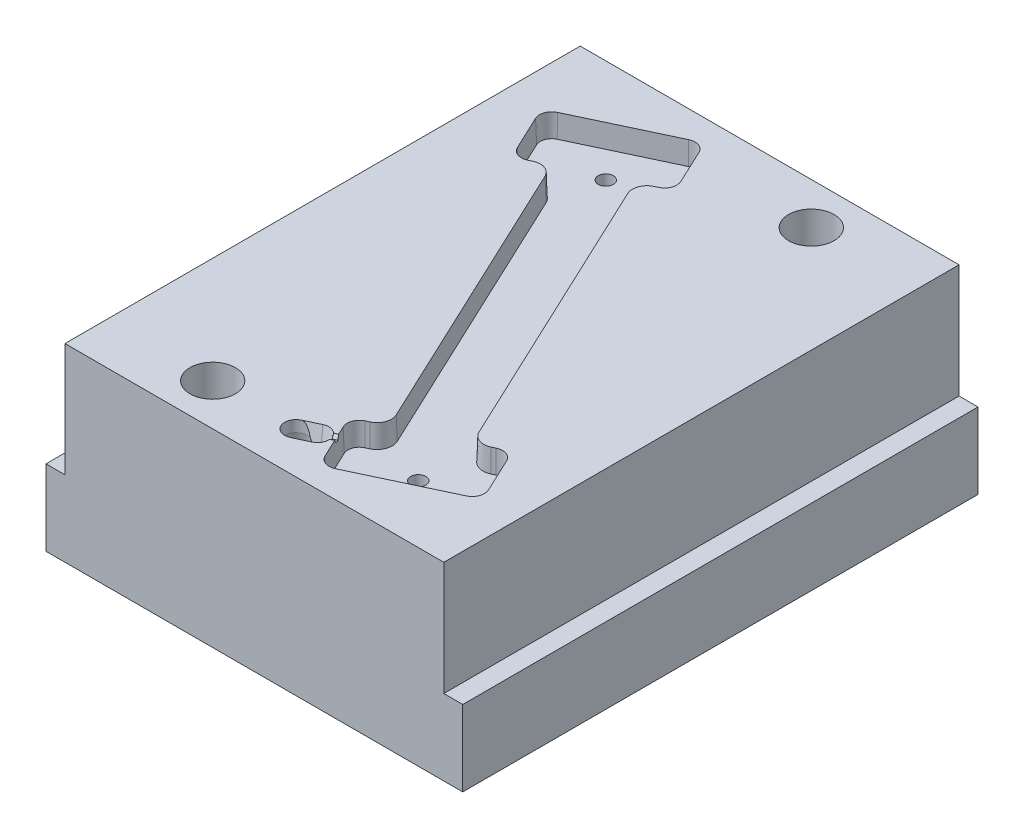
ISO-10303-21;
HEADER;
FILE_DESCRIPTION(('STEP AP214'),'2;1');
FILE_NAME('part.step','',(''),(''),'','','');
FILE_SCHEMA(('AUTOMOTIVE_DESIGN { 1 0 10303 214 1 1 1 1 }'));
ENDSEC;
DATA;
#1=APPLICATION_CONTEXT('core data for automotive mechanical design processes');
#2=APPLICATION_PROTOCOL_DEFINITION('international standard','automotive_design',2000,#1);
#3=PRODUCT_CONTEXT('',#1,'mechanical');
#4=PRODUCT('Part','Part','',(#3));
#5=PRODUCT_RELATED_PRODUCT_CATEGORY('part','',(#4));
#6=PRODUCT_DEFINITION_FORMATION('','',#4);
#7=PRODUCT_DEFINITION_CONTEXT('part definition',#1,'design');
#8=PRODUCT_DEFINITION('design','',#6,#7);
#9=PRODUCT_DEFINITION_SHAPE('','',#8);
#10=(LENGTH_UNIT() NAMED_UNIT(*) SI_UNIT(.MILLI.,.METRE.));
#11=(NAMED_UNIT(*) PLANE_ANGLE_UNIT() SI_UNIT($,.RADIAN.));
#12=(NAMED_UNIT(*) SI_UNIT($,.STERADIAN.) SOLID_ANGLE_UNIT());
#13=UNCERTAINTY_MEASURE_WITH_UNIT(LENGTH_MEASURE(1.E-05),#10,'distance_accuracy_value','');
#14=(GEOMETRIC_REPRESENTATION_CONTEXT(3) GLOBAL_UNCERTAINTY_ASSIGNED_CONTEXT((#13)) GLOBAL_UNIT_ASSIGNED_CONTEXT((#10,
#11,#12)) REPRESENTATION_CONTEXT('',''));
#15=CARTESIAN_POINT('',(0.,0.,0.));
#16=DIRECTION('',(0.,0.,1.));
#17=DIRECTION('',(1.,0.,0.));
#18=AXIS2_PLACEMENT_3D('',#15,#16,#17);
#19=CARTESIAN_POINT('',(25.,25.,68.));
#20=DIRECTION('',(0.,-1.,0.));
#21=DIRECTION('',(0.,0.,-1.));
#22=AXIS2_PLACEMENT_3D('',#19,#20,#21);
#23=PLANE('',#22);
#24=DIRECTION('',(-1.,0.,0.));
#25=VECTOR('',#24,1.);
#26=CARTESIAN_POINT('',(25.,25.,0.));
#27=LINE('',#26,#25);
#28=CARTESIAN_POINT('',(25.,25.,0.));
#29=VERTEX_POINT('',#28);
#30=CARTESIAN_POINT('',(-25.,25.,0.));
#31=VERTEX_POINT('',#30);
#32=EDGE_CURVE('E400',#29,#31,#27,.T.);
#33=ORIENTED_EDGE('',*,*,#32,.T.);
#34=DIRECTION('',(0.,0.,-1.));
#35=VECTOR('',#34,1.);
#36=CARTESIAN_POINT('',(-25.,25.,68.));
#37=LINE('',#36,#35);
#38=CARTESIAN_POINT('',(-25.,25.,68.));
#39=VERTEX_POINT('',#38);
#40=EDGE_CURVE('E478',#39,#31,#37,.T.);
#41=ORIENTED_EDGE('',*,*,#40,.F.);
#42=DIRECTION('',(-1.,0.,0.));
#43=VECTOR('',#42,1.);
#44=CARTESIAN_POINT('',(25.,25.,68.));
#45=LINE('',#44,#43);
#46=CARTESIAN_POINT('',(25.,25.,68.));
#47=VERTEX_POINT('',#46);
#48=EDGE_CURVE('E401',#47,#39,#45,.T.);
#49=ORIENTED_EDGE('',*,*,#48,.F.);
#50=DIRECTION('',(0.,0.,-1.));
#51=VECTOR('',#50,1.);
#52=CARTESIAN_POINT('',(25.,25.,68.));
#53=LINE('',#52,#51);
#54=EDGE_CURVE('E427',#47,#29,#53,.T.);
#55=ORIENTED_EDGE('',*,*,#54,.T.);
#56=EDGE_LOOP('',(#33,#41,#49,#55));
#57=FACE_BOUND('',#56,.T.);
#58=CARTESIAN_POINT('',(11.,25.,5.5));
#59=DIRECTION('',(0.,1.,0.));
#60=DIRECTION('',(0.,0.,1.));
#61=AXIS2_PLACEMENT_3D('',#58,#59,#60);
#62=CIRCLE('',#61,3.);
#63=CARTESIAN_POINT('',(11.,25.,8.5));
#64=VERTEX_POINT('',#63);
#65=EDGE_CURVE('E577',#64,#64,#62,.T.);
#66=ORIENTED_EDGE('',*,*,#65,.F.);
#67=EDGE_LOOP('',(#66));
#68=FACE_BOUND('',#67,.T.);
#69=CARTESIAN_POINT('',(-11.,25.,62.5));
#70=DIRECTION('',(0.,1.,0.));
#71=DIRECTION('',(0.,0.,1.));
#72=AXIS2_PLACEMENT_3D('',#69,#70,#71);
#73=CIRCLE('',#72,3.);
#74=CARTESIAN_POINT('',(-11.,25.,65.5));
#75=VERTEX_POINT('',#74);
#76=EDGE_CURVE('E503',#75,#75,#73,.T.);
#77=ORIENTED_EDGE('',*,*,#76,.F.);
#78=EDGE_LOOP('',(#77));
#79=FACE_BOUND('',#78,.T.);
#80=DIRECTION('',(-0.42579703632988,0.,-0.904818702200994));
#81=VECTOR('',#80,1.);
#82=CARTESIAN_POINT('',(2.88578835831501,25.,59.1666326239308));
#83=LINE('',#82,#81);
#84=CARTESIAN_POINT('',(2.88578835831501,25.,59.1666326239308));
#85=VERTEX_POINT('',#84);
#86=CARTESIAN_POINT('',(3.41746318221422,25.,60.2964416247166));
#87=VERTEX_POINT('',#86);
#88=EDGE_CURVE('E736',#85,#87,#83,.F.);
#89=ORIENTED_EDGE('',*,*,#88,.F.);
#90=CARTESIAN_POINT('',(4.33780730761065,25.,58.4833295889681));
#91=DIRECTION('',(0.,1.,0.));
#92=DIRECTION('',(0.,0.,1.));
#93=AXIS2_PLACEMENT_3D('',#90,#91,#92);
#94=CIRCLE('',#93,1.60476230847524);
#95=CARTESIAN_POINT('',(3.654504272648,25.,57.0313106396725));
#96=VERTEX_POINT('',#95);
#97=EDGE_CURVE('E740',#96,#85,#94,.T.);
#98=ORIENTED_EDGE('',*,*,#97,.F.);
#99=DIRECTION('',(0.904818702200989,0.,-0.425797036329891));
#100=VECTOR('',#99,1.);
#101=CARTESIAN_POINT('',(4.10691362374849,25.,56.8184121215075));
#102=LINE('',#101,#100);
#103=CARTESIAN_POINT('',(4.10691362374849,25.,56.8184121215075));
#104=VERTEX_POINT('',#103);
#105=EDGE_CURVE('E743',#104,#96,#102,.F.);
#106=ORIENTED_EDGE('',*,*,#105,.F.);
#107=CARTESIAN_POINT('',(3.29992703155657,25.,55.1035656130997));
#108=DIRECTION('',(0.,1.,0.));
#109=DIRECTION('',(0.,0.,1.));
#110=AXIS2_PLACEMENT_3D('',#107,#108,#109);
#111=CIRCLE('',#110,1.89523769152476);
#112=CARTESIAN_POINT('',(5.01477353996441,25.,54.2965790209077));
#113=VERTEX_POINT('',#112);
#114=EDGE_CURVE('E746',#113,#104,#111,.F.);
#115=ORIENTED_EDGE('',*,*,#114,.F.);
#116=DIRECTION('',(-0.42579703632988,0.,-0.904818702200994));
#117=VECTOR('',#116,1.);
#118=CARTESIAN_POINT('',(-12.4429049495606,25.,17.199012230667));
#119=LINE('',#118,#117);
#120=CARTESIAN_POINT('',(-12.4429049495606,25.,17.199012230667));
#121=VERTEX_POINT('',#120);
#122=EDGE_CURVE('E749',#121,#113,#119,.F.);
#123=ORIENTED_EDGE('',*,*,#122,.F.);
#124=CARTESIAN_POINT('',(-14.1577514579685,25.,18.0059988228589));
#125=DIRECTION('',(0.,1.,0.));
#126=DIRECTION('',(0.,0.,1.));
#127=AXIS2_PLACEMENT_3D('',#124,#125,#126);
#128=CIRCLE('',#127,1.89523769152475);
#129=CARTESIAN_POINT('',(-14.9647380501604,25.,16.2911523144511));
#130=VERTEX_POINT('',#129);
#131=EDGE_CURVE('E752',#130,#121,#128,.F.);
#132=ORIENTED_EDGE('',*,*,#131,.F.);
#133=DIRECTION('',(-0.904818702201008,0.,0.425797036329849));
#134=VECTOR('',#133,1.);
#135=CARTESIAN_POINT('',(-15.4171474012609,25.,16.504050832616));
#136=LINE('',#135,#134);
#137=CARTESIAN_POINT('',(-15.4171474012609,25.,16.504050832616));
#138=VERTEX_POINT('',#137);
#139=EDGE_CURVE('E755',#138,#130,#136,.F.);
#140=ORIENTED_EDGE('',*,*,#139,.F.);
#141=CARTESIAN_POINT('',(-16.1004504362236,25.,15.0520318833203));
#142=DIRECTION('',(0.,1.,0.));
#143=DIRECTION('',(0.,0.,1.));
#144=AXIS2_PLACEMENT_3D('',#141,#142,#143);
#145=CIRCLE('',#144,1.60476230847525);
#146=CARTESIAN_POINT('',(-17.5524693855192,25.,15.735334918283));
#147=VERTEX_POINT('',#146);
#148=EDGE_CURVE('E299',#147,#138,#145,.T.);
#149=ORIENTED_EDGE('',*,*,#148,.F.);
#150=DIRECTION('',(-0.42579703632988,0.,-0.904818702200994));
#151=VECTOR('',#150,1.);
#152=CARTESIAN_POINT('',(-19.6814545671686,25.,11.211241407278));
#153=LINE('',#152,#151);
#154=CARTESIAN_POINT('',(-19.6814545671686,25.,11.211241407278));
#155=VERTEX_POINT('',#154);
#156=EDGE_CURVE('E687',#155,#147,#153,.F.);
#157=ORIENTED_EDGE('',*,*,#156,.F.);
#158=CARTESIAN_POINT('',(-18.2294356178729,25.,10.5279383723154));
#159=DIRECTION('',(0.,1.,0.));
#160=DIRECTION('',(0.,0.,1.));
#161=AXIS2_PLACEMENT_3D('',#158,#159,#160);
#162=CIRCLE('',#161,1.60476230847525);
#163=CARTESIAN_POINT('',(-18.9127386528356,25.,9.07591942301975));
#164=VERTEX_POINT('',#163);
#165=EDGE_CURVE('E691',#164,#155,#162,.T.);
#166=ORIENTED_EDGE('',*,*,#165,.F.);
#167=DIRECTION('',(0.904818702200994,0.,-0.42579703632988));
#168=VECTOR('',#167,1.);
#169=CARTESIAN_POINT('',(-7.1500955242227,25.,3.54055795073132));
#170=LINE('',#169,#168);
#171=CARTESIAN_POINT('',(-7.1500955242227,25.,3.54055795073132));
#172=VERTEX_POINT('',#171);
#173=EDGE_CURVE('E694',#172,#164,#170,.F.);
#174=ORIENTED_EDGE('',*,*,#173,.F.);
#175=CARTESIAN_POINT('',(-6.46679248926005,25.,4.99257690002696));
#176=DIRECTION('',(0.,1.,0.));
#177=DIRECTION('',(0.,0.,1.));
#178=AXIS2_PLACEMENT_3D('',#175,#176,#177);
#179=CIRCLE('',#178,1.60476230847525);
#180=CARTESIAN_POINT('',(-5.0147735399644,25.,4.3092738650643));
#181=VERTEX_POINT('',#180);
#182=EDGE_CURVE('E697',#181,#172,#179,.T.);
#183=ORIENTED_EDGE('',*,*,#182,.F.);
#184=DIRECTION('',(0.425797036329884,0.,0.904818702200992));
#185=VECTOR('',#184,1.);
#186=CARTESIAN_POINT('',(-2.88578835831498,25.,8.83336737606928));
#187=LINE('',#186,#185);
#188=CARTESIAN_POINT('',(-2.88578835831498,25.,8.83336737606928));
#189=VERTEX_POINT('',#188);
#190=EDGE_CURVE('E700',#189,#181,#187,.F.);
#191=ORIENTED_EDGE('',*,*,#190,.F.);
#192=CARTESIAN_POINT('',(-4.33780730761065,25.,9.51667041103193));
#193=DIRECTION('',(0.,1.,0.));
#194=DIRECTION('',(0.,0.,1.));
#195=AXIS2_PLACEMENT_3D('',#192,#193,#194);
#196=CIRCLE('',#195,1.60476230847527);
#197=CARTESIAN_POINT('',(-3.65450427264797,25.,10.9686893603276));
#198=VERTEX_POINT('',#197);
#199=EDGE_CURVE('E703',#198,#189,#196,.T.);
#200=ORIENTED_EDGE('',*,*,#199,.F.);
#201=DIRECTION('',(-0.904818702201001,0.,0.425797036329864));
#202=VECTOR('',#201,1.);
#203=CARTESIAN_POINT('',(-4.10691362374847,25.,11.1815878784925));
#204=LINE('',#203,#202);
#205=CARTESIAN_POINT('',(-4.10691362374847,25.,11.1815878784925));
#206=VERTEX_POINT('',#205);
#207=EDGE_CURVE('E706',#206,#198,#204,.F.);
#208=ORIENTED_EDGE('',*,*,#207,.F.);
#209=CARTESIAN_POINT('',(-3.29992703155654,25.,12.8964343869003));
#210=DIRECTION('',(0.,1.,0.));
#211=DIRECTION('',(0.,0.,1.));
#212=AXIS2_PLACEMENT_3D('',#209,#210,#211);
#213=CIRCLE('',#212,1.89523769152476);
#214=CARTESIAN_POINT('',(-5.01477353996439,25.,13.7034209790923));
#215=VERTEX_POINT('',#214);
#216=EDGE_CURVE('E709',#215,#206,#213,.F.);
#217=ORIENTED_EDGE('',*,*,#216,.F.);
#218=DIRECTION('',(0.425797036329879,0.,0.904818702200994));
#219=VECTOR('',#218,1.);
#220=CARTESIAN_POINT('',(12.4429049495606,25.,50.800987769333));
#221=LINE('',#220,#219);
#222=CARTESIAN_POINT('',(12.4429049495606,25.,50.800987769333));
#223=VERTEX_POINT('',#222);
#224=EDGE_CURVE('E712',#223,#215,#221,.F.);
#225=ORIENTED_EDGE('',*,*,#224,.F.);
#226=CARTESIAN_POINT('',(14.1577514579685,25.,49.9940011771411));
#227=DIRECTION('',(0.,1.,0.));
#228=DIRECTION('',(0.,0.,1.));
#229=AXIS2_PLACEMENT_3D('',#226,#227,#228);
#230=CIRCLE('',#229,1.89523769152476);
#231=CARTESIAN_POINT('',(14.9647380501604,25.,51.708847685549));
#232=VERTEX_POINT('',#231);
#233=EDGE_CURVE('E715',#232,#223,#230,.F.);
#234=ORIENTED_EDGE('',*,*,#233,.F.);
#235=DIRECTION('',(0.904818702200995,0.,-0.425797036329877));
#236=VECTOR('',#235,1.);
#237=CARTESIAN_POINT('',(15.4171474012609,25.,51.495949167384));
#238=LINE('',#237,#236);
#239=CARTESIAN_POINT('',(15.4171474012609,25.,51.495949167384));
#240=VERTEX_POINT('',#239);
#241=EDGE_CURVE('E718',#240,#232,#238,.F.);
#242=ORIENTED_EDGE('',*,*,#241,.F.);
#243=CARTESIAN_POINT('',(16.1004504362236,25.,52.9479681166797));
#244=DIRECTION('',(0.,1.,0.));
#245=DIRECTION('',(0.,0.,1.));
#246=AXIS2_PLACEMENT_3D('',#243,#244,#245);
#247=CIRCLE('',#246,1.60476230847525);
#248=CARTESIAN_POINT('',(17.5524693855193,25.,52.264665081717));
#249=VERTEX_POINT('',#248);
#250=EDGE_CURVE('E721',#249,#240,#247,.T.);
#251=ORIENTED_EDGE('',*,*,#250,.F.);
#252=DIRECTION('',(0.42579703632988,0.,0.904818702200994));
#253=VECTOR('',#252,1.);
#254=CARTESIAN_POINT('',(19.6814545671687,25.,56.788758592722));
#255=LINE('',#254,#253);
#256=CARTESIAN_POINT('',(19.6814545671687,25.,56.788758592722));
#257=VERTEX_POINT('',#256);
#258=EDGE_CURVE('E724',#257,#249,#255,.F.);
#259=ORIENTED_EDGE('',*,*,#258,.F.);
#260=CARTESIAN_POINT('',(18.229435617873,25.,57.4720616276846));
#261=DIRECTION('',(0.,1.,0.));
#262=DIRECTION('',(0.,0.,1.));
#263=AXIS2_PLACEMENT_3D('',#260,#261,#262);
#264=CIRCLE('',#263,1.60476230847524);
#265=CARTESIAN_POINT('',(18.9127386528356,25.,58.9240805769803));
#266=VERTEX_POINT('',#265);
#267=EDGE_CURVE('E727',#266,#257,#264,.T.);
#268=ORIENTED_EDGE('',*,*,#267,.F.);
#269=DIRECTION('',(-0.904818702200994,0.,0.42579703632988));
#270=VECTOR('',#269,1.);
#271=CARTESIAN_POINT('',(7.1500955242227,25.,64.4594420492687));
#272=LINE('',#271,#270);
#273=CARTESIAN_POINT('',(7.1500955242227,25.,64.4594420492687));
#274=VERTEX_POINT('',#273);
#275=EDGE_CURVE('E730',#274,#266,#272,.F.);
#276=ORIENTED_EDGE('',*,*,#275,.F.);
#277=CARTESIAN_POINT('',(6.46679248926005,25.,63.0074230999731));
#278=DIRECTION('',(0.,1.,0.));
#279=DIRECTION('',(0.,0.,1.));
#280=AXIS2_PLACEMENT_3D('',#277,#278,#279);
#281=CIRCLE('',#280,1.60476230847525);
#282=CARTESIAN_POINT('',(5.01477353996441,25.,63.6907261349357));
#283=VERTEX_POINT('',#282);
#284=EDGE_CURVE('E733',#283,#274,#281,.T.);
#285=ORIENTED_EDGE('',*,*,#284,.F.);
#286=CARTESIAN_POINT('',(3.87619573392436,25.,61.2712482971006));
#287=VERTEX_POINT('',#286);
#288=EDGE_CURVE('E739',#287,#283,#83,.F.);
#289=ORIENTED_EDGE('',*,*,#288,.F.);
#290=DIRECTION('',(0.904818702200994,0.,-0.42579703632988));
#291=VECTOR('',#290,1.);
#292=CARTESIAN_POINT('',(-24.4049821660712,25.,74.5800378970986));
#293=LINE('',#292,#291);
#294=CARTESIAN_POINT('',(3.42804018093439,25.,61.4821450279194));
#295=VERTEX_POINT('',#294);
#296=EDGE_CURVE('E557',#295,#287,#293,.T.);
#297=ORIENTED_EDGE('',*,*,#296,.F.);
#298=CARTESIAN_POINT('',(1.93198294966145,25.,61.5908315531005));
#299=DIRECTION('',(0.,1.,0.));
#300=DIRECTION('',(0.,0.,-1.));
#301=AXIS2_PLACEMENT_3D('',#298,#299,#300);
#302=CIRCLE('',#301,1.5);
#303=CARTESIAN_POINT('',(2.57067850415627,25.,62.948059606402));
#304=VERTEX_POINT('',#303);
#305=EDGE_CURVE('E528',#304,#295,#302,.T.);
#306=ORIENTED_EDGE('',*,*,#305,.F.);
#307=DIRECTION('',(0.904818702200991,0.,-0.425797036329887));
#308=VECTOR('',#307,1.);
#309=CARTESIAN_POINT('',(2.57067850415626,25.,62.948059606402));
#310=LINE('',#309,#308);
#311=CARTESIAN_POINT('',(0.638695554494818,25.,63.8572280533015));
#312=VERTEX_POINT('',#311);
#313=EDGE_CURVE('E493',#312,#304,#310,.T.);
#314=ORIENTED_EDGE('',*,*,#313,.F.);
#315=CARTESIAN_POINT('',(0.,25.,62.5));
#316=DIRECTION('',(0.,1.,0.));
#317=DIRECTION('',(0.,0.,1.));
#318=AXIS2_PLACEMENT_3D('',#315,#316,#317);
#319=CIRCLE('',#318,1.5);
#320=CARTESIAN_POINT('',(-0.638695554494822,25.,61.1427719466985));
#321=VERTEX_POINT('',#320);
#322=EDGE_CURVE('E308',#321,#312,#319,.T.);
#323=ORIENTED_EDGE('',*,*,#322,.F.);
#324=DIRECTION('',(-0.904818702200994,0.,0.42579703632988));
#325=VECTOR('',#324,1.);
#326=CARTESIAN_POINT('',(-0.638695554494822,25.,61.1427719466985));
#327=LINE('',#326,#325);
#328=CARTESIAN_POINT('',(1.29328739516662,25.,60.233603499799));
#329=VERTEX_POINT('',#328);
#330=EDGE_CURVE('E523',#329,#321,#327,.T.);
#331=ORIENTED_EDGE('',*,*,#330,.F.);
#332=CARTESIAN_POINT('',(2.96930762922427,25.,60.5073383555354));
#333=VERTEX_POINT('',#332);
#334=EDGE_CURVE('E541',#333,#329,#302,.T.);
#335=ORIENTED_EDGE('',*,*,#334,.F.);
#336=DIRECTION('',(0.904818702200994,0.,-0.42579703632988));
#337=VECTOR('',#336,1.);
#338=CARTESIAN_POINT('',(-24.8637147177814,25.,73.6052312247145));
#339=LINE('',#338,#337);
#340=EDGE_CURVE('E551',#333,#87,#339,.T.);
#341=ORIENTED_EDGE('',*,*,#340,.T.);
#342=EDGE_LOOP('',(#89,#98,#106,#115,#123,#132,#140,#149,#157,#166,#174,#183,#191,#200,#208,
#217,#225,#234,#242,#251,#259,#268,#276,#285,#289,#297,#306,#314,#323,#331,#335,#341));
#343=FACE_BOUND('',#342,.T.);
#344=ADVANCED_FACE('F17',(#57,#68,#79,#343),#23,.F.);
#345=CARTESIAN_POINT('',(-24.8637147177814,25.,73.6052312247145));
#346=DIRECTION('',(-0.368751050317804,-0.499999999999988,-0.783595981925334));
#347=DIRECTION('',(0.,0.843003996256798,-0.537907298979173));
#348=AXIS2_PLACEMENT_3D('',#345,#346,#347);
#349=PLANE('',#348);
#350=DIRECTION('',(-0.240152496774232,0.865629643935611,-0.439331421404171));
#351=VECTOR('',#350,1.);
#352=CARTESIAN_POINT('',(3.19056085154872,25.8178694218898,59.8813498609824));
#353=LINE('',#352,#351);
#354=CARTESIAN_POINT('',(3.55617868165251,24.5,60.5502057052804));
#355=VERTEX_POINT('',#354);
#356=EDGE_CURVE('E615',#87,#355,#353,.F.);
#357=ORIENTED_EDGE('',*,*,#356,.F.);
#358=ORIENTED_EDGE('',*,*,#340,.F.);
#359=CARTESIAN_POINT('',(1.61715588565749,25.3476361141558,60.9218240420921));
#360=DIRECTION('',(-0.368751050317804,-0.499999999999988,-0.783595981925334));
#361=DIRECTION('',(-0.212898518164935,0.866025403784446,-0.452409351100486));
#362=AXIS2_PLACEMENT_3D('',#359,#360,#361);
#363=ELLIPSE('',#362,3.18629763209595,1.41118248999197);
#364=CARTESIAN_POINT('',(3.04066357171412,24.5,60.7928010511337));
#365=VERTEX_POINT('',#364);
#366=EDGE_CURVE('E561',#333,#365,#363,.T.);
#367=ORIENTED_EDGE('',*,*,#366,.T.);
#368=DIRECTION('',(0.904818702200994,0.,-0.42579703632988));
#369=VECTOR('',#368,1.);
#370=CARTESIAN_POINT('',(-24.7407977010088,24.5,73.8664298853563));
#371=LINE('',#370,#369);
#372=EDGE_CURVE('E555',#365,#355,#371,.T.);
#373=ORIENTED_EDGE('',*,*,#372,.T.);
#374=EDGE_LOOP('',(#357,#358,#367,#373));
#375=FACE_BOUND('',#374,.T.);
#376=ADVANCED_FACE('F799',(#375),#349,.F.);
#377=CARTESIAN_POINT('',(-24.7407977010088,24.5,73.8664298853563));
#378=DIRECTION('',(0.,-1.,0.));
#379=DIRECTION('',(0.,0.,-1.));
#380=AXIS2_PLACEMENT_3D('',#377,#378,#379);
#381=PLANE('',#380);
#382=DIRECTION('',(-0.42579703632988,0.,-0.904818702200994));
#383=VECTOR('',#382,1.);
#384=CARTESIAN_POINT('',(3.55617868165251,24.5,60.5502057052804));
#385=LINE('',#384,#383);
#386=CARTESIAN_POINT('',(3.76907719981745,24.5,61.0026150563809));
#387=VERTEX_POINT('',#386);
#388=EDGE_CURVE('E31',#355,#387,#385,.F.);
#389=ORIENTED_EDGE('',*,*,#388,.F.);
#390=ORIENTED_EDGE('',*,*,#372,.F.);
#391=CARTESIAN_POINT('',(1.93198294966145,24.5,61.5908315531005));
#392=DIRECTION('',(0.,-1.,0.));
#393=DIRECTION('',(0.,0.,-1.));
#394=AXIS2_PLACEMENT_3D('',#391,#392,#393);
#395=CIRCLE('',#394,1.36602540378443);
#396=CARTESIAN_POINT('',(3.25356208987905,24.5,61.2452104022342));
#397=VERTEX_POINT('',#396);
#398=EDGE_CURVE('E572',#365,#397,#395,.T.);
#399=ORIENTED_EDGE('',*,*,#398,.T.);
#400=DIRECTION('',(0.904818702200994,0.,-0.42579703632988));
#401=VECTOR('',#400,1.);
#402=CARTESIAN_POINT('',(-24.5278991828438,24.5,74.3188392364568));
#403=LINE('',#402,#401);
#404=EDGE_CURVE('E562',#397,#387,#403,.T.);
#405=ORIENTED_EDGE('',*,*,#404,.T.);
#406=EDGE_LOOP('',(#389,#390,#399,#405));
#407=FACE_BOUND('',#406,.T.);
#408=ADVANCED_FACE('F805',(#407),#381,.F.);
#409=CARTESIAN_POINT('',(-24.4049821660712,25.,74.5800378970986));
#410=DIRECTION('',(0.368751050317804,-0.49999999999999,0.783595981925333));
#411=DIRECTION('',(0.,-0.843003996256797,-0.537907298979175));
#412=AXIS2_PLACEMENT_3D('',#409,#410,#411);
#413=PLANE('',#412);
#414=DIRECTION('',(-0.185449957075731,-0.86562964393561,-0.465073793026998));
#415=VECTOR('',#414,1.);
#416=CARTESIAN_POINT('',(4.05141368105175,25.8178694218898,61.7106621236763));
#417=LINE('',#416,#415);
#418=EDGE_CURVE('E11',#387,#287,#417,.F.);
#419=ORIENTED_EDGE('',*,*,#418,.F.);
#420=ORIENTED_EDGE('',*,*,#404,.F.);
#421=CARTESIAN_POINT('',(2.2468100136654,25.3476361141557,62.2598390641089));
#422=DIRECTION('',(0.368751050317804,-0.49999999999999,0.783595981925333));
#423=DIRECTION('',(0.212898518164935,0.866025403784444,0.452409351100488));
#424=AXIS2_PLACEMENT_3D('',#421,#422,#423);
#425=ELLIPSE('',#424,3.18629763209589,1.41118248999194);
#426=EDGE_CURVE('E550',#397,#295,#425,.T.);
#427=ORIENTED_EDGE('',*,*,#426,.T.);
#428=ORIENTED_EDGE('',*,*,#296,.T.);
#429=EDGE_LOOP('',(#419,#420,#427,#428));
#430=FACE_BOUND('',#429,.T.);
#431=ADVANCED_FACE('F831',(#430),#413,.F.);
#432=CARTESIAN_POINT('',(0.,0.,62.5));
#433=DIRECTION('',(0.,1.,0.));
#434=DIRECTION('',(0.,0.,1.));
#435=AXIS2_PLACEMENT_3D('',#432,#433,#434);
#436=CYLINDRICAL_SURFACE('',#435,1.5);
#437=CARTESIAN_POINT('',(0.,23.5,62.5));
#438=DIRECTION('',(0.,-1.,0.));
#439=DIRECTION('',(0.,0.,-1.));
#440=AXIS2_PLACEMENT_3D('',#437,#438,#439);
#441=CIRCLE('',#440,1.5);
#442=CARTESIAN_POINT('',(1.39216926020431,23.5,63.0584485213));
#443=VERTEX_POINT('',#442);
#444=CARTESIAN_POINT('',(0.457054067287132,23.5,61.0713287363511));
#445=VERTEX_POINT('',#444);
#446=EDGE_CURVE('E611',#443,#445,#441,.T.);
#447=ORIENTED_EDGE('',*,*,#446,.T.);
#448=CARTESIAN_POINT('',(0.,19.4019237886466,62.5));
#449=DIRECTION('',(-0.411288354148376,-0.258819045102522,-0.873987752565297));
#450=DIRECTION('',(-0.110204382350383,0.965925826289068,-0.234184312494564));
#451=AXIS2_PLACEMENT_3D('',#448,#449,#450);
#452=ELLIPSE('',#451,5.7955549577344,1.5);
#453=EDGE_CURVE('E486',#445,#321,#452,.F.);
#454=ORIENTED_EDGE('',*,*,#453,.T.);
#455=ORIENTED_EDGE('',*,*,#322,.T.);
#456=CARTESIAN_POINT('',(0.,19.4019237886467,62.5));
#457=DIRECTION('',(0.411288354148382,-0.258819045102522,0.873987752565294));
#458=DIRECTION('',(0.110204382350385,0.965925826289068,0.234184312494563));
#459=AXIS2_PLACEMENT_3D('',#456,#457,#458);
#460=ELLIPSE('',#459,5.7955549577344,1.5);
#461=EDGE_CURVE('E482',#312,#443,#460,.F.);
#462=ORIENTED_EDGE('',*,*,#461,.T.);
#463=EDGE_LOOP('',(#447,#454,#455,#462));
#464=FACE_BOUND('',#463,.T.);
#465=ADVANCED_FACE('F778',(#464),#436,.F.);
#466=CARTESIAN_POINT('',(0.,10.,62.5));
#467=DIRECTION('',(0.,-1.,0.));
#468=DIRECTION('',(0.,0.,-1.));
#469=AXIS2_PLACEMENT_3D('',#466,#467,#468);
#470=CIRCLE('',#469,1.5);
#471=CARTESIAN_POINT('',(0.,10.,61.));
#472=VERTEX_POINT('',#471);
#473=EDGE_CURVE('E500',#472,#472,#470,.F.);
#474=ORIENTED_EDGE('',*,*,#473,.F.);
#475=EDGE_LOOP('',(#474));
#476=FACE_BOUND('',#475,.T.);
#477=CARTESIAN_POINT('',(0.,22.,62.5));
#478=DIRECTION('',(0.,-1.,0.));
#479=DIRECTION('',(0.,0.,-1.));
#480=AXIS2_PLACEMENT_3D('',#477,#478,#479);
#481=CIRCLE('',#480,1.5);
#482=CARTESIAN_POINT('',(0.,22.,61.));
#483=VERTEX_POINT('',#482);
#484=EDGE_CURVE('E607',#483,#483,#481,.T.);
#485=ORIENTED_EDGE('',*,*,#484,.F.);
#486=EDGE_LOOP('',(#485));
#487=FACE_BOUND('',#486,.T.);
#488=ADVANCED_FACE('F854',(#476,#487),#436,.F.);
#489=CARTESIAN_POINT('',(-0.638695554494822,25.,61.1427719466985));
#490=DIRECTION('',(-0.411288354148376,-0.258819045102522,-0.873987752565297));
#491=DIRECTION('',(-0.904818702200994,0.,0.42579703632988));
#492=AXIS2_PLACEMENT_3D('',#489,#490,#491);
#493=PLANE('',#492);
#494=CARTESIAN_POINT('',(0.576288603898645,14.3508356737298,63.7246132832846));
#495=DIRECTION('',(-0.411288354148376,-0.258819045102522,-0.873987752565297));
#496=DIRECTION('',(0.110204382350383,-0.965925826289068,0.234184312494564));
#497=AXIS2_PLACEMENT_3D('',#494,#495,#496);
#498=ELLIPSE('',#497,10.5088424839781,2.35923878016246);
#499=CARTESIAN_POINT('',(0.706839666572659,23.,61.1018504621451));
#500=VERTEX_POINT('',#499);
#501=EDGE_CURVE('E595',#500,#445,#498,.F.);
#502=ORIENTED_EDGE('',*,*,#501,.F.);
#503=DIRECTION('',(-0.904818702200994,0.,0.42579703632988));
#504=VECTOR('',#503,1.);
#505=CARTESIAN_POINT('',(-0.410511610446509,23.,61.6276628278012));
#506=LINE('',#505,#504);
#507=CARTESIAN_POINT('',(1.52147133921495,23.,60.7184943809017));
#508=VERTEX_POINT('',#507);
#509=EDGE_CURVE('E514',#508,#500,#506,.T.);
#510=ORIENTED_EDGE('',*,*,#509,.F.);
#511=DIRECTION('',(-0.110204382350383,0.965925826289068,-0.234184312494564));
#512=VECTOR('',#511,1.);
#513=CARTESIAN_POINT('',(1.29328739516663,25.,60.233603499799));
#514=LINE('',#513,#512);
#515=EDGE_CURVE('E313',#508,#329,#514,.T.);
#516=ORIENTED_EDGE('',*,*,#515,.T.);
#517=ORIENTED_EDGE('',*,*,#330,.T.);
#518=ORIENTED_EDGE('',*,*,#453,.F.);
#519=EDGE_LOOP('',(#502,#510,#516,#517,#518));
#520=FACE_BOUND('',#519,.T.);
#521=ADVANCED_FACE('F771',(#520),#493,.F.);
#522=CARTESIAN_POINT('',(2.57067850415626,25.,62.948059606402));
#523=DIRECTION('',(0.411288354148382,-0.258819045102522,0.873987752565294));
#524=DIRECTION('',(0.904818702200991,0.,-0.425797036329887));
#525=AXIS2_PLACEMENT_3D('',#522,#523,#524);
#526=PLANE('',#525);
#527=CARTESIAN_POINT('',(-0.576288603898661,14.3508356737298,61.2753867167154));
#528=DIRECTION('',(0.411288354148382,-0.258819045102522,0.873987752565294));
#529=DIRECTION('',(-0.110204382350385,-0.965925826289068,-0.234184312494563));
#530=AXIS2_PLACEMENT_3D('',#527,#528,#529);
#531=ELLIPSE('',#530,10.5088424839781,2.35923878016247);
#532=CARTESIAN_POINT('',(1.52786288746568,23.,62.8465248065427));
#533=VERTEX_POINT('',#532);
#534=EDGE_CURVE('E39',#443,#533,#531,.F.);
#535=ORIENTED_EDGE('',*,*,#534,.F.);
#536=ORIENTED_EDGE('',*,*,#461,.F.);
#537=ORIENTED_EDGE('',*,*,#313,.T.);
#538=DIRECTION('',(0.110204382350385,0.965925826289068,0.234184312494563));
#539=VECTOR('',#538,1.);
#540=CARTESIAN_POINT('',(2.57067850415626,25.,62.948059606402));
#541=LINE('',#540,#539);
#542=CARTESIAN_POINT('',(2.34249456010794,23.,62.4631687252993));
#543=VERTEX_POINT('',#542);
#544=EDGE_CURVE('E519',#543,#304,#541,.T.);
#545=ORIENTED_EDGE('',*,*,#544,.F.);
#546=DIRECTION('',(0.904818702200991,0.,-0.425797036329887));
#547=VECTOR('',#546,1.);
#548=CARTESIAN_POINT('',(0.410511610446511,23.,63.3723371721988));
#549=LINE('',#548,#547);
#550=EDGE_CURVE('E511',#533,#543,#549,.T.);
#551=ORIENTED_EDGE('',*,*,#550,.F.);
#552=EDGE_LOOP('',(#535,#536,#537,#545,#551));
#553=FACE_BOUND('',#552,.T.);
#554=ADVANCED_FACE('F517',(#553),#526,.F.);
#555=CARTESIAN_POINT('',(0.,23.,62.5));
#556=DIRECTION('',(0.,1.,0.));
#557=DIRECTION('',(0.,0.,1.));
#558=AXIS2_PLACEMENT_3D('',#555,#556,#557);
#559=PLANE('',#558);
#560=ORIENTED_EDGE('',*,*,#509,.T.);
#561=CARTESIAN_POINT('',(0.,23.,62.5));
#562=DIRECTION('',(0.,1.,0.));
#563=DIRECTION('',(0.,0.,1.));
#564=AXIS2_PLACEMENT_3D('',#561,#562,#563);
#565=CIRCLE('',#564,1.56666666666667);
#566=EDGE_CURVE('E25',#500,#533,#565,.F.);
#567=ORIENTED_EDGE('',*,*,#566,.T.);
#568=ORIENTED_EDGE('',*,*,#550,.T.);
#569=CARTESIAN_POINT('',(1.93198294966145,23.,61.5908315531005));
#570=DIRECTION('',(0.,1.,0.));
#571=DIRECTION('',(0.,0.,1.));
#572=AXIS2_PLACEMENT_3D('',#569,#570,#571);
#573=CIRCLE('',#572,0.964101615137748);
#574=EDGE_CURVE('E522',#543,#508,#573,.T.);
#575=ORIENTED_EDGE('',*,*,#574,.T.);
#576=EDGE_LOOP('',(#560,#567,#568,#575));
#577=FACE_BOUND('',#576,.T.);
#578=ADVANCED_FACE('F509',(#577),#559,.T.);
#579=CARTESIAN_POINT('',(-25.,25.,68.));
#580=DIRECTION('',(1.,0.,0.));
#581=DIRECTION('',(0.,1.,0.));
#582=AXIS2_PLACEMENT_3D('',#579,#580,#581);
#583=PLANE('',#582);
#584=DIRECTION('',(0.,-1.,0.));
#585=VECTOR('',#584,1.);
#586=CARTESIAN_POINT('',(-25.,25.,0.));
#587=LINE('',#586,#585);
#588=CARTESIAN_POINT('',(-25.,10.,0.));
#589=VERTEX_POINT('',#588);
#590=EDGE_CURVE('E431',#31,#589,#587,.T.);
#591=ORIENTED_EDGE('',*,*,#590,.T.);
#592=DIRECTION('',(0.,0.,-1.));
#593=VECTOR('',#592,1.);
#594=CARTESIAN_POINT('',(-25.,10.,68.));
#595=LINE('',#594,#593);
#596=CARTESIAN_POINT('',(-25.,10.,68.));
#597=VERTEX_POINT('',#596);
#598=EDGE_CURVE('E474',#597,#589,#595,.T.);
#599=ORIENTED_EDGE('',*,*,#598,.F.);
#600=DIRECTION('',(0.,-1.,0.));
#601=VECTOR('',#600,1.);
#602=CARTESIAN_POINT('',(-25.,25.,68.));
#603=LINE('',#602,#601);
#604=EDGE_CURVE('E405',#39,#597,#603,.T.);
#605=ORIENTED_EDGE('',*,*,#604,.F.);
#606=ORIENTED_EDGE('',*,*,#40,.T.);
#607=EDGE_LOOP('',(#591,#599,#605,#606));
#608=FACE_BOUND('',#607,.T.);
#609=ADVANCED_FACE('F847',(#608),#583,.F.);
#610=CARTESIAN_POINT('',(-25.,10.,68.));
#611=DIRECTION('',(0.,-1.,0.));
#612=DIRECTION('',(1.,0.,0.));
#613=AXIS2_PLACEMENT_3D('',#610,#611,#612);
#614=PLANE('',#613);
#615=DIRECTION('',(-1.,0.,0.));
#616=VECTOR('',#615,1.);
#617=CARTESIAN_POINT('',(-25.,10.,0.));
#618=LINE('',#617,#616);
#619=CARTESIAN_POINT('',(-27.5,10.,0.));
#620=VERTEX_POINT('',#619);
#621=EDGE_CURVE('E434',#589,#620,#618,.T.);
#622=ORIENTED_EDGE('',*,*,#621,.T.);
#623=DIRECTION('',(0.,0.,-1.));
#624=VECTOR('',#623,1.);
#625=CARTESIAN_POINT('',(-27.5,10.,68.));
#626=LINE('',#625,#624);
#627=CARTESIAN_POINT('',(-27.5,10.,68.));
#628=VERTEX_POINT('',#627);
#629=EDGE_CURVE('E470',#628,#620,#626,.T.);
#630=ORIENTED_EDGE('',*,*,#629,.F.);
#631=DIRECTION('',(-1.,0.,0.));
#632=VECTOR('',#631,1.);
#633=CARTESIAN_POINT('',(-25.,10.,68.));
#634=LINE('',#633,#632);
#635=EDGE_CURVE('E409',#597,#628,#634,.T.);
#636=ORIENTED_EDGE('',*,*,#635,.F.);
#637=ORIENTED_EDGE('',*,*,#598,.T.);
#638=EDGE_LOOP('',(#622,#630,#636,#637));
#639=FACE_BOUND('',#638,.T.);
#640=ADVANCED_FACE('F887',(#639),#614,.F.);
#641=CARTESIAN_POINT('',(-27.5,10.,68.));
#642=DIRECTION('',(1.,0.,0.));
#643=DIRECTION('',(0.,1.,0.));
#644=AXIS2_PLACEMENT_3D('',#641,#642,#643);
#645=PLANE('',#644);
#646=DIRECTION('',(0.,-1.,0.));
#647=VECTOR('',#646,1.);
#648=CARTESIAN_POINT('',(-27.5,10.,0.));
#649=LINE('',#648,#647);
#650=CARTESIAN_POINT('',(-27.5,0.,0.));
#651=VERTEX_POINT('',#650);
#652=EDGE_CURVE('E437',#620,#651,#649,.T.);
#653=ORIENTED_EDGE('',*,*,#652,.T.);
#654=DIRECTION('',(0.,0.,-1.));
#655=VECTOR('',#654,1.);
#656=CARTESIAN_POINT('',(-27.5,0.,68.));
#657=LINE('',#656,#655);
#658=CARTESIAN_POINT('',(-27.5,0.,68.));
#659=VERTEX_POINT('',#658);
#660=EDGE_CURVE('E466',#659,#651,#657,.T.);
#661=ORIENTED_EDGE('',*,*,#660,.F.);
#662=DIRECTION('',(0.,-1.,0.));
#663=VECTOR('',#662,1.);
#664=CARTESIAN_POINT('',(-27.5,10.,68.));
#665=LINE('',#664,#663);
#666=EDGE_CURVE('E412',#628,#659,#665,.T.);
#667=ORIENTED_EDGE('',*,*,#666,.F.);
#668=ORIENTED_EDGE('',*,*,#629,.T.);
#669=EDGE_LOOP('',(#653,#661,#667,#668));
#670=FACE_BOUND('',#669,.T.);
#671=ADVANCED_FACE('F883',(#670),#645,.F.);
#672=CARTESIAN_POINT('',(-27.5,0.,68.));
#673=DIRECTION('',(0.,1.,0.));
#674=DIRECTION('',(0.,0.,1.));
#675=AXIS2_PLACEMENT_3D('',#672,#673,#674);
#676=PLANE('',#675);
#677=CARTESIAN_POINT('',(0.,0.,62.5));
#678=DIRECTION('',(0.,-1.,0.));
#679=DIRECTION('',(0.,0.,-1.));
#680=AXIS2_PLACEMENT_3D('',#677,#678,#679);
#681=CIRCLE('',#680,3.1);
#682=CARTESIAN_POINT('',(0.,0.,59.4));
#683=VERTEX_POINT('',#682);
#684=EDGE_CURVE('E591',#683,#683,#681,.T.);
#685=ORIENTED_EDGE('',*,*,#684,.F.);
#686=EDGE_LOOP('',(#685));
#687=FACE_BOUND('',#686,.T.);
#688=CARTESIAN_POINT('',(-11.,0.,62.5));
#689=DIRECTION('',(0.,1.,0.));
#690=DIRECTION('',(0.,0.,1.));
#691=AXIS2_PLACEMENT_3D('',#688,#689,#690);
#692=CIRCLE('',#691,3.);
#693=CARTESIAN_POINT('',(-11.,0.,65.5));
#694=VERTEX_POINT('',#693);
#695=EDGE_CURVE('E581',#694,#694,#692,.T.);
#696=ORIENTED_EDGE('',*,*,#695,.T.);
#697=EDGE_LOOP('',(#696));
#698=FACE_BOUND('',#697,.T.);
#699=CARTESIAN_POINT('',(11.,0.,5.5));
#700=DIRECTION('',(0.,1.,0.));
#701=DIRECTION('',(0.,0.,1.));
#702=AXIS2_PLACEMENT_3D('',#699,#700,#701);
#703=CIRCLE('',#702,3.);
#704=CARTESIAN_POINT('',(11.,0.,8.5));
#705=VERTEX_POINT('',#704);
#706=EDGE_CURVE('E556',#705,#705,#703,.T.);
#707=ORIENTED_EDGE('',*,*,#706,.T.);
#708=EDGE_LOOP('',(#707));
#709=FACE_BOUND('',#708,.T.);
#710=CARTESIAN_POINT('',(11.,0.,57.375));
#711=DIRECTION('',(0.,1.,0.));
#712=DIRECTION('',(0.,0.,1.));
#713=AXIS2_PLACEMENT_3D('',#710,#711,#712);
#714=CIRCLE('',#713,1.);
#715=CARTESIAN_POINT('',(11.,0.,58.375));
#716=VERTEX_POINT('',#715);
#717=EDGE_CURVE('E499',#716,#716,#714,.T.);
#718=ORIENTED_EDGE('',*,*,#717,.T.);
#719=EDGE_LOOP('',(#718));
#720=FACE_BOUND('',#719,.T.);
#721=CARTESIAN_POINT('',(-11.,0.,10.625));
#722=DIRECTION('',(0.,1.,0.));
#723=DIRECTION('',(0.,0.,1.));
#724=AXIS2_PLACEMENT_3D('',#721,#722,#723);
#725=CIRCLE('',#724,1.);
#726=CARTESIAN_POINT('',(-11.,0.,11.625));
#727=VERTEX_POINT('',#726);
#728=EDGE_CURVE('E494',#727,#727,#725,.T.);
#729=ORIENTED_EDGE('',*,*,#728,.T.);
#730=EDGE_LOOP('',(#729));
#731=FACE_BOUND('',#730,.T.);
#732=DIRECTION('',(1.,0.,0.));
#733=VECTOR('',#732,1.);
#734=CARTESIAN_POINT('',(-27.5,0.,0.));
#735=LINE('',#734,#733);
#736=CARTESIAN_POINT('',(27.5,0.,0.));
#737=VERTEX_POINT('',#736);
#738=EDGE_CURVE('E440',#651,#737,#735,.T.);
#739=ORIENTED_EDGE('',*,*,#738,.T.);
#740=DIRECTION('',(0.,0.,-1.));
#741=VECTOR('',#740,1.);
#742=CARTESIAN_POINT('',(27.5,0.,68.));
#743=LINE('',#742,#741);
#744=CARTESIAN_POINT('',(27.5,0.,68.));
#745=VERTEX_POINT('',#744);
#746=EDGE_CURVE('E462',#745,#737,#743,.T.);
#747=ORIENTED_EDGE('',*,*,#746,.F.);
#748=DIRECTION('',(1.,0.,0.));
#749=VECTOR('',#748,1.);
#750=CARTESIAN_POINT('',(-27.5,0.,68.));
#751=LINE('',#750,#749);
#752=EDGE_CURVE('E415',#659,#745,#751,.T.);
#753=ORIENTED_EDGE('',*,*,#752,.F.);
#754=ORIENTED_EDGE('',*,*,#660,.T.);
#755=EDGE_LOOP('',(#739,#747,#753,#754));
#756=FACE_BOUND('',#755,.T.);
#757=ADVANCED_FACE('F879',(#687,#698,#709,#720,#731,#756),#676,.F.);
#758=CARTESIAN_POINT('',(27.5,10.,68.));
#759=DIRECTION('',(-1.,0.,0.));
#760=DIRECTION('',(0.,0.,1.));
#761=AXIS2_PLACEMENT_3D('',#758,#759,#760);
#762=PLANE('',#761);
#763=DIRECTION('',(0.,1.,0.));
#764=VECTOR('',#763,1.);
#765=CARTESIAN_POINT('',(27.5,10.,0.));
#766=LINE('',#765,#764);
#767=CARTESIAN_POINT('',(27.5,10.,0.));
#768=VERTEX_POINT('',#767);
#769=EDGE_CURVE('E443',#737,#768,#766,.T.);
#770=ORIENTED_EDGE('',*,*,#769,.T.);
#771=DIRECTION('',(0.,0.,-1.));
#772=VECTOR('',#771,1.);
#773=CARTESIAN_POINT('',(27.5,10.,68.));
#774=LINE('',#773,#772);
#775=CARTESIAN_POINT('',(27.5,10.,68.));
#776=VERTEX_POINT('',#775);
#777=EDGE_CURVE('E458',#776,#768,#774,.T.);
#778=ORIENTED_EDGE('',*,*,#777,.F.);
#779=DIRECTION('',(0.,1.,0.));
#780=VECTOR('',#779,1.);
#781=CARTESIAN_POINT('',(27.5,10.,68.));
#782=LINE('',#781,#780);
#783=EDGE_CURVE('E418',#745,#776,#782,.T.);
#784=ORIENTED_EDGE('',*,*,#783,.F.);
#785=ORIENTED_EDGE('',*,*,#746,.T.);
#786=EDGE_LOOP('',(#770,#778,#784,#785));
#787=FACE_BOUND('',#786,.T.);
#788=ADVANCED_FACE('F875',(#787),#762,.F.);
#789=CARTESIAN_POINT('',(27.5,10.,68.));
#790=DIRECTION('',(0.,-1.,0.));
#791=DIRECTION('',(0.,0.,-1.));
#792=AXIS2_PLACEMENT_3D('',#789,#790,#791);
#793=PLANE('',#792);
#794=DIRECTION('',(-1.,0.,0.));
#795=VECTOR('',#794,1.);
#796=CARTESIAN_POINT('',(27.5,10.,0.));
#797=LINE('',#796,#795);
#798=CARTESIAN_POINT('',(25.,10.,0.));
#799=VERTEX_POINT('',#798);
#800=EDGE_CURVE('E446',#768,#799,#797,.T.);
#801=ORIENTED_EDGE('',*,*,#800,.T.);
#802=DIRECTION('',(0.,0.,-1.));
#803=VECTOR('',#802,1.);
#804=CARTESIAN_POINT('',(25.,10.,68.));
#805=LINE('',#804,#803);
#806=CARTESIAN_POINT('',(25.,10.,68.));
#807=VERTEX_POINT('',#806);
#808=EDGE_CURVE('E454',#807,#799,#805,.T.);
#809=ORIENTED_EDGE('',*,*,#808,.F.);
#810=DIRECTION('',(-1.,0.,0.));
#811=VECTOR('',#810,1.);
#812=CARTESIAN_POINT('',(27.5,10.,68.));
#813=LINE('',#812,#811);
#814=EDGE_CURVE('E421',#776,#807,#813,.T.);
#815=ORIENTED_EDGE('',*,*,#814,.F.);
#816=ORIENTED_EDGE('',*,*,#777,.T.);
#817=EDGE_LOOP('',(#801,#809,#815,#816));
#818=FACE_BOUND('',#817,.T.);
#819=ADVANCED_FACE('F871',(#818),#793,.F.);
#820=CARTESIAN_POINT('',(25.,10.,68.));
#821=DIRECTION('',(-1.,0.,0.));
#822=DIRECTION('',(0.,-1.,0.));
#823=AXIS2_PLACEMENT_3D('',#820,#821,#822);
#824=PLANE('',#823);
#825=DIRECTION('',(0.,1.,0.));
#826=VECTOR('',#825,1.);
#827=CARTESIAN_POINT('',(25.,10.,0.));
#828=LINE('',#827,#826);
#829=EDGE_CURVE('E406',#799,#29,#828,.T.);
#830=ORIENTED_EDGE('',*,*,#829,.T.);
#831=ORIENTED_EDGE('',*,*,#54,.F.);
#832=DIRECTION('',(0.,1.,0.));
#833=VECTOR('',#832,1.);
#834=CARTESIAN_POINT('',(25.,10.,68.));
#835=LINE('',#834,#833);
#836=EDGE_CURVE('E424',#807,#47,#835,.T.);
#837=ORIENTED_EDGE('',*,*,#836,.F.);
#838=ORIENTED_EDGE('',*,*,#808,.T.);
#839=EDGE_LOOP('',(#830,#831,#837,#838));
#840=FACE_BOUND('',#839,.T.);
#841=ADVANCED_FACE('F864',(#840),#824,.F.);
#842=CARTESIAN_POINT('',(-25.,25.,68.));
#843=DIRECTION('',(0.,0.,1.));
#844=DIRECTION('',(1.,0.,0.));
#845=AXIS2_PLACEMENT_3D('',#842,#843,#844);
#846=PLANE('',#845);
#847=ORIENTED_EDGE('',*,*,#48,.T.);
#848=ORIENTED_EDGE('',*,*,#604,.T.);
#849=ORIENTED_EDGE('',*,*,#635,.T.);
#850=ORIENTED_EDGE('',*,*,#666,.T.);
#851=ORIENTED_EDGE('',*,*,#752,.T.);
#852=ORIENTED_EDGE('',*,*,#783,.T.);
#853=ORIENTED_EDGE('',*,*,#814,.T.);
#854=ORIENTED_EDGE('',*,*,#836,.T.);
#855=EDGE_LOOP('',(#847,#848,#849,#850,#851,#852,#853,#854));
#856=FACE_BOUND('',#855,.T.);
#857=ADVANCED_FACE('F861',(#856),#846,.T.);
#858=CARTESIAN_POINT('',(-25.,25.,0.));
#859=DIRECTION('',(0.,0.,1.));
#860=DIRECTION('',(1.,0.,0.));
#861=AXIS2_PLACEMENT_3D('',#858,#859,#860);
#862=PLANE('',#861);
#863=ORIENTED_EDGE('',*,*,#32,.F.);
#864=ORIENTED_EDGE('',*,*,#829,.F.);
#865=ORIENTED_EDGE('',*,*,#800,.F.);
#866=ORIENTED_EDGE('',*,*,#769,.F.);
#867=ORIENTED_EDGE('',*,*,#738,.F.);
#868=ORIENTED_EDGE('',*,*,#652,.F.);
#869=ORIENTED_EDGE('',*,*,#621,.F.);
#870=ORIENTED_EDGE('',*,*,#590,.F.);
#871=EDGE_LOOP('',(#863,#864,#865,#866,#867,#868,#869,#870));
#872=FACE_BOUND('',#871,.T.);
#873=ADVANCED_FACE('F859',(#872),#862,.F.);
#874=CARTESIAN_POINT('',(-16.1004504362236,22.,15.0520318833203));
#875=DIRECTION('',(0.,1.,0.));
#876=DIRECTION('',(0.,0.,1.));
#877=AXIS2_PLACEMENT_3D('',#874,#875,#876);
#878=PLANE('',#877);
#879=CARTESIAN_POINT('',(11.,22.,57.375));
#880=DIRECTION('',(0.,1.,0.));
#881=DIRECTION('',(0.,0.,1.));
#882=AXIS2_PLACEMENT_3D('',#879,#880,#881);
#883=CIRCLE('',#882,1.);
#884=CARTESIAN_POINT('',(11.,22.,58.375));
#885=VERTEX_POINT('',#884);
#886=EDGE_CURVE('E495',#885,#885,#883,.T.);
#887=ORIENTED_EDGE('',*,*,#886,.F.);
#888=EDGE_LOOP('',(#887));
#889=FACE_BOUND('',#888,.T.);
#890=CARTESIAN_POINT('',(-11.,22.,10.625));
#891=DIRECTION('',(0.,1.,0.));
#892=DIRECTION('',(0.,0.,1.));
#893=AXIS2_PLACEMENT_3D('',#890,#891,#892);
#894=CIRCLE('',#893,1.);
#895=CARTESIAN_POINT('',(-11.,22.,11.625));
#896=VERTEX_POINT('',#895);
#897=EDGE_CURVE('E489',#896,#896,#894,.T.);
#898=ORIENTED_EDGE('',*,*,#897,.F.);
#899=EDGE_LOOP('',(#898));
#900=FACE_BOUND('',#899,.T.);
#901=CARTESIAN_POINT('',(-16.1004504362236,22.,15.0520318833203));
#902=DIRECTION('',(0.,1.,0.));
#903=DIRECTION('',(0.,0.,1.));
#904=AXIS2_PLACEMENT_3D('',#901,#902,#903);
#905=CIRCLE('',#904,1.5);
#906=CARTESIAN_POINT('',(-17.4576784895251,22.,15.6907274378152));
#907=VERTEX_POINT('',#906);
#908=CARTESIAN_POINT('',(-15.4617548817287,22.,16.4092599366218));
#909=VERTEX_POINT('',#908);
#910=EDGE_CURVE('E292',#907,#909,#905,.T.);
#911=ORIENTED_EDGE('',*,*,#910,.T.);
#912=DIRECTION('',(0.904818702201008,0.,-0.42579703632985));
#913=VECTOR('',#912,1.);
#914=CARTESIAN_POINT('',(-15.4617548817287,22.,16.4092599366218));
#915=LINE('',#914,#913);
#916=CARTESIAN_POINT('',(-15.0093455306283,22.,16.1963614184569));
#917=VERTEX_POINT('',#916);
#918=EDGE_CURVE('E279',#909,#917,#915,.T.);
#919=ORIENTED_EDGE('',*,*,#918,.T.);
#920=CARTESIAN_POINT('',(-14.1577514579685,22.,18.0059988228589));
#921=DIRECTION('',(0.,-1.,0.));
#922=DIRECTION('',(0.,0.,1.));
#923=AXIS2_PLACEMENT_3D('',#920,#921,#922);
#924=CIRCLE('',#923,2.);
#925=CARTESIAN_POINT('',(-12.3481140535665,22.,17.1544047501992));
#926=VERTEX_POINT('',#925);
#927=EDGE_CURVE('E291',#917,#926,#924,.T.);
#928=ORIENTED_EDGE('',*,*,#927,.T.);
#929=DIRECTION('',(0.42579703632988,0.,0.904818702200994));
#930=VECTOR('',#929,1.);
#931=CARTESIAN_POINT('',(-12.3481140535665,22.,17.1544047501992));
#932=LINE('',#931,#930);
#933=CARTESIAN_POINT('',(5.10956443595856,22.,54.2519715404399));
#934=VERTEX_POINT('',#933);
#935=EDGE_CURVE('E319',#926,#934,#932,.T.);
#936=ORIENTED_EDGE('',*,*,#935,.T.);
#937=CARTESIAN_POINT('',(3.29992703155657,22.,55.1035656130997));
#938=DIRECTION('',(0.,-1.,0.));
#939=DIRECTION('',(0.,0.,-1.));
#940=AXIS2_PLACEMENT_3D('',#937,#938,#939);
#941=CIRCLE('',#940,2.);
#942=CARTESIAN_POINT('',(4.15152110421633,22.,56.9132030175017));
#943=VERTEX_POINT('',#942);
#944=EDGE_CURVE('E323',#934,#943,#941,.T.);
#945=ORIENTED_EDGE('',*,*,#944,.T.);
#946=DIRECTION('',(-0.904818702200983,0.,0.425797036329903));
#947=VECTOR('',#946,1.);
#948=CARTESIAN_POINT('',(3.69911175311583,22.,57.1261015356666));
#949=LINE('',#948,#947);
#950=CARTESIAN_POINT('',(3.69911175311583,22.,57.1261015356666));
#951=VERTEX_POINT('',#950);
#952=EDGE_CURVE('E327',#943,#951,#949,.T.);
#953=ORIENTED_EDGE('',*,*,#952,.T.);
#954=CARTESIAN_POINT('',(4.33780730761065,22.,58.4833295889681));
#955=DIRECTION('',(0.,1.,0.));
#956=DIRECTION('',(0.,0.,-1.));
#957=AXIS2_PLACEMENT_3D('',#954,#955,#956);
#958=CIRCLE('',#957,1.5);
#959=CARTESIAN_POINT('',(2.98057925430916,22.,59.1220251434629));
#960=VERTEX_POINT('',#959);
#961=EDGE_CURVE('E331',#951,#960,#958,.T.);
#962=ORIENTED_EDGE('',*,*,#961,.T.);
#963=DIRECTION('',(0.42579703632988,0.,0.904818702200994));
#964=VECTOR('',#963,1.);
#965=CARTESIAN_POINT('',(5.10956443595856,22.,63.6461186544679));
#966=LINE('',#965,#964);
#967=CARTESIAN_POINT('',(5.10956443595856,22.,63.6461186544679));
#968=VERTEX_POINT('',#967);
#969=EDGE_CURVE('E335',#960,#968,#966,.T.);
#970=ORIENTED_EDGE('',*,*,#969,.T.);
#971=CARTESIAN_POINT('',(6.46679248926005,22.,63.0074230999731));
#972=DIRECTION('',(0.,1.,0.));
#973=DIRECTION('',(0.,0.,-1.));
#974=AXIS2_PLACEMENT_3D('',#971,#972,#973);
#975=CIRCLE('',#974,1.5);
#976=CARTESIAN_POINT('',(7.10548804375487,22.,64.3646511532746));
#977=VERTEX_POINT('',#976);
#978=EDGE_CURVE('E339',#968,#977,#975,.T.);
#979=ORIENTED_EDGE('',*,*,#978,.T.);
#980=DIRECTION('',(0.904818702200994,0.,-0.42579703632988));
#981=VECTOR('',#980,1.);
#982=CARTESIAN_POINT('',(7.10548804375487,22.,64.3646511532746));
#983=LINE('',#982,#981);
#984=CARTESIAN_POINT('',(18.8681311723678,22.,58.8292896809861));
#985=VERTEX_POINT('',#984);
#986=EDGE_CURVE('E343',#977,#985,#983,.T.);
#987=ORIENTED_EDGE('',*,*,#986,.T.);
#988=CARTESIAN_POINT('',(18.229435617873,22.,57.4720616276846));
#989=DIRECTION('',(0.,1.,0.));
#990=DIRECTION('',(0.,0.,1.));
#991=AXIS2_PLACEMENT_3D('',#988,#989,#990);
#992=CIRCLE('',#991,1.5);
#993=CARTESIAN_POINT('',(19.5866636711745,22.,56.8333660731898));
#994=VERTEX_POINT('',#993);
#995=EDGE_CURVE('E347',#985,#994,#992,.T.);
#996=ORIENTED_EDGE('',*,*,#995,.T.);
#997=DIRECTION('',(-0.42579703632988,0.,-0.904818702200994));
#998=VECTOR('',#997,1.);
#999=CARTESIAN_POINT('',(19.5866636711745,22.,56.8333660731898));
#1000=LINE('',#999,#998);
#1001=CARTESIAN_POINT('',(17.4576784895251,22.,52.3092725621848));
#1002=VERTEX_POINT('',#1001);
#1003=EDGE_CURVE('E351',#994,#1002,#1000,.T.);
#1004=ORIENTED_EDGE('',*,*,#1003,.T.);
#1005=CARTESIAN_POINT('',(16.1004504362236,22.,52.9479681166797));
#1006=DIRECTION('',(0.,1.,0.));
#1007=DIRECTION('',(0.,0.,1.));
#1008=AXIS2_PLACEMENT_3D('',#1005,#1006,#1007);
#1009=CIRCLE('',#1008,1.5);
#1010=CARTESIAN_POINT('',(15.4617548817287,22.,51.5907400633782));
#1011=VERTEX_POINT('',#1010);
#1012=EDGE_CURVE('E355',#1002,#1011,#1009,.T.);
#1013=ORIENTED_EDGE('',*,*,#1012,.T.);
#1014=DIRECTION('',(-0.904818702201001,0.,0.425797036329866));
#1015=VECTOR('',#1014,1.);
#1016=CARTESIAN_POINT('',(15.4617548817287,22.,51.5907400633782));
#1017=LINE('',#1016,#1015);
#1018=CARTESIAN_POINT('',(15.0093455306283,22.,51.8036385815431));
#1019=VERTEX_POINT('',#1018);
#1020=EDGE_CURVE('E359',#1011,#1019,#1017,.T.);
#1021=ORIENTED_EDGE('',*,*,#1020,.T.);
#1022=CARTESIAN_POINT('',(14.1577514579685,22.,49.9940011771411));
#1023=DIRECTION('',(0.,-1.,0.));
#1024=DIRECTION('',(0.,0.,1.));
#1025=AXIS2_PLACEMENT_3D('',#1022,#1023,#1024);
#1026=CIRCLE('',#1025,2.);
#1027=CARTESIAN_POINT('',(12.3481140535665,22.,50.8455952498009));
#1028=VERTEX_POINT('',#1027);
#1029=EDGE_CURVE('E363',#1019,#1028,#1026,.T.);
#1030=ORIENTED_EDGE('',*,*,#1029,.T.);
#1031=DIRECTION('',(-0.42579703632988,0.,-0.904818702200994));
#1032=VECTOR('',#1031,1.);
#1033=CARTESIAN_POINT('',(-5.10956443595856,22.,13.7480284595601));
#1034=LINE('',#1033,#1032);
#1035=CARTESIAN_POINT('',(-5.10956443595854,22.,13.7480284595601));
#1036=VERTEX_POINT('',#1035);
#1037=EDGE_CURVE('E367',#1028,#1036,#1034,.T.);
#1038=ORIENTED_EDGE('',*,*,#1037,.T.);
#1039=CARTESIAN_POINT('',(-3.29992703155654,22.,12.8964343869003));
#1040=DIRECTION('',(0.,-1.,0.));
#1041=DIRECTION('',(0.,0.,-1.));
#1042=AXIS2_PLACEMENT_3D('',#1039,#1040,#1041);
#1043=CIRCLE('',#1042,2.);
#1044=CARTESIAN_POINT('',(-4.1515211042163,22.,11.0867969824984));
#1045=VERTEX_POINT('',#1044);
#1046=EDGE_CURVE('E371',#1036,#1045,#1043,.T.);
#1047=ORIENTED_EDGE('',*,*,#1046,.T.);
#1048=DIRECTION('',(0.90481870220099,0.,-0.425797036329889));
#1049=VECTOR('',#1048,1.);
#1050=CARTESIAN_POINT('',(-3.69911175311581,22.,10.8738984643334));
#1051=LINE('',#1050,#1049);
#1052=CARTESIAN_POINT('',(-3.6991117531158,22.,10.8738984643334));
#1053=VERTEX_POINT('',#1052);
#1054=EDGE_CURVE('E375',#1045,#1053,#1051,.T.);
#1055=ORIENTED_EDGE('',*,*,#1054,.T.);
#1056=CARTESIAN_POINT('',(-4.33780730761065,22.,9.51667041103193));
#1057=DIRECTION('',(0.,1.,0.));
#1058=DIRECTION('',(0.,0.,-1.));
#1059=AXIS2_PLACEMENT_3D('',#1056,#1057,#1058);
#1060=CIRCLE('',#1059,1.5);
#1061=CARTESIAN_POINT('',(-2.98057925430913,22.,8.87797485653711));
#1062=VERTEX_POINT('',#1061);
#1063=EDGE_CURVE('E379',#1053,#1062,#1060,.T.);
#1064=ORIENTED_EDGE('',*,*,#1063,.T.);
#1065=DIRECTION('',(-0.425797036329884,0.,-0.904818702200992));
#1066=VECTOR('',#1065,1.);
#1067=CARTESIAN_POINT('',(-5.10956443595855,22.,4.35388134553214));
#1068=LINE('',#1067,#1066);
#1069=CARTESIAN_POINT('',(-5.10956443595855,22.,4.35388134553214));
#1070=VERTEX_POINT('',#1069);
#1071=EDGE_CURVE('E383',#1062,#1070,#1068,.T.);
#1072=ORIENTED_EDGE('',*,*,#1071,.T.);
#1073=CARTESIAN_POINT('',(-6.46679248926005,22.,4.99257690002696));
#1074=DIRECTION('',(0.,1.,0.));
#1075=DIRECTION('',(0.,0.,-1.));
#1076=AXIS2_PLACEMENT_3D('',#1073,#1074,#1075);
#1077=CIRCLE('',#1076,1.5);
#1078=CARTESIAN_POINT('',(-7.10548804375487,22.,3.63534884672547));
#1079=VERTEX_POINT('',#1078);
#1080=EDGE_CURVE('E387',#1070,#1079,#1077,.T.);
#1081=ORIENTED_EDGE('',*,*,#1080,.T.);
#1082=DIRECTION('',(-0.904818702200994,0.,0.42579703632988));
#1083=VECTOR('',#1082,1.);
#1084=CARTESIAN_POINT('',(-18.8681311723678,22.,9.1707103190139));
#1085=LINE('',#1084,#1083);
#1086=CARTESIAN_POINT('',(-18.8681311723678,22.,9.1707103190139));
#1087=VERTEX_POINT('',#1086);
#1088=EDGE_CURVE('E391',#1079,#1087,#1085,.T.);
#1089=ORIENTED_EDGE('',*,*,#1088,.T.);
#1090=CARTESIAN_POINT('',(-18.2294356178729,22.,10.5279383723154));
#1091=DIRECTION('',(0.,1.,0.));
#1092=DIRECTION('',(0.,0.,1.));
#1093=AXIS2_PLACEMENT_3D('',#1090,#1091,#1092);
#1094=CIRCLE('',#1093,1.5);
#1095=CARTESIAN_POINT('',(-19.5866636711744,22.,11.1666339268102));
#1096=VERTEX_POINT('',#1095);
#1097=EDGE_CURVE('E395',#1087,#1096,#1094,.T.);
#1098=ORIENTED_EDGE('',*,*,#1097,.T.);
#1099=DIRECTION('',(0.42579703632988,0.,0.904818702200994));
#1100=VECTOR('',#1099,1.);
#1101=CARTESIAN_POINT('',(-19.5866636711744,22.,11.1666339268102));
#1102=LINE('',#1101,#1100);
#1103=EDGE_CURVE('E306',#1096,#907,#1102,.T.);
#1104=ORIENTED_EDGE('',*,*,#1103,.T.);
#1105=EDGE_LOOP('',(#911,#919,#928,#936,#945,#953,#962,#970,#979,#987,#996,#1004,#1013,#1021,
#1030,#1038,#1047,#1055,#1064,#1072,#1081,#1089,#1098,#1104));
#1106=FACE_BOUND('',#1105,.T.);
#1107=ADVANCED_FACE('F303',(#889,#900,#1106),#878,.T.);
#1108=CARTESIAN_POINT('',(1.93198294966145,25.,61.5908315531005));
#1109=DIRECTION('',(0.,1.,0.));
#1110=DIRECTION('',(0.,0.,-1.));
#1111=AXIS2_PLACEMENT_3D('',#1108,#1109,#1110);
#1112=CONICAL_SURFACE('',#1111,1.5,0.26179938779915);
#1113=ORIENTED_EDGE('',*,*,#398,.F.);
#1114=ORIENTED_EDGE('',*,*,#366,.F.);
#1115=ORIENTED_EDGE('',*,*,#334,.T.);
#1116=ORIENTED_EDGE('',*,*,#515,.F.);
#1117=ORIENTED_EDGE('',*,*,#574,.F.);
#1118=ORIENTED_EDGE('',*,*,#544,.T.);
#1119=ORIENTED_EDGE('',*,*,#305,.T.);
#1120=ORIENTED_EDGE('',*,*,#426,.F.);
#1121=EDGE_LOOP('',(#1113,#1114,#1115,#1116,#1117,#1118,#1119,#1120));
#1122=FACE_BOUND('',#1121,.T.);
#1123=ADVANCED_FACE('F767',(#1122),#1112,.F.);
#1124=CARTESIAN_POINT('',(-11.,0.,10.625));
#1125=DIRECTION('',(0.,1.,0.));
#1126=DIRECTION('',(0.,0.,1.));
#1127=AXIS2_PLACEMENT_3D('',#1124,#1125,#1126);
#1128=CYLINDRICAL_SURFACE('',#1127,1.);
#1129=ORIENTED_EDGE('',*,*,#897,.T.);
#1130=EDGE_LOOP('',(#1129));
#1131=FACE_BOUND('',#1130,.T.);
#1132=ORIENTED_EDGE('',*,*,#728,.F.);
#1133=EDGE_LOOP('',(#1132));
#1134=FACE_BOUND('',#1133,.T.);
#1135=ADVANCED_FACE('F840',(#1131,#1134),#1128,.F.);
#1136=CARTESIAN_POINT('',(11.,0.,57.375));
#1137=DIRECTION('',(0.,1.,0.));
#1138=DIRECTION('',(0.,0.,1.));
#1139=AXIS2_PLACEMENT_3D('',#1136,#1137,#1138);
#1140=CYLINDRICAL_SURFACE('',#1139,1.);
#1141=ORIENTED_EDGE('',*,*,#886,.T.);
#1142=EDGE_LOOP('',(#1141));
#1143=FACE_BOUND('',#1142,.T.);
#1144=ORIENTED_EDGE('',*,*,#717,.F.);
#1145=EDGE_LOOP('',(#1144));
#1146=FACE_BOUND('',#1145,.T.);
#1147=ADVANCED_FACE('F826',(#1143,#1146),#1140,.F.);
#1148=CARTESIAN_POINT('',(11.,0.,5.5));
#1149=DIRECTION('',(0.,1.,0.));
#1150=DIRECTION('',(0.,0.,1.));
#1151=AXIS2_PLACEMENT_3D('',#1148,#1149,#1150);
#1152=CYLINDRICAL_SURFACE('',#1151,3.);
#1153=ORIENTED_EDGE('',*,*,#706,.F.);
#1154=EDGE_LOOP('',(#1153));
#1155=FACE_BOUND('',#1154,.T.);
#1156=ORIENTED_EDGE('',*,*,#65,.T.);
#1157=EDGE_LOOP('',(#1156));
#1158=FACE_BOUND('',#1157,.T.);
#1159=ADVANCED_FACE('F817',(#1155,#1158),#1152,.F.);
#1160=CARTESIAN_POINT('',(-11.,0.,62.5));
#1161=DIRECTION('',(0.,1.,0.));
#1162=DIRECTION('',(0.,0.,1.));
#1163=AXIS2_PLACEMENT_3D('',#1160,#1161,#1162);
#1164=CYLINDRICAL_SURFACE('',#1163,3.);
#1165=ORIENTED_EDGE('',*,*,#695,.F.);
#1166=EDGE_LOOP('',(#1165));
#1167=FACE_BOUND('',#1166,.T.);
#1168=ORIENTED_EDGE('',*,*,#76,.T.);
#1169=EDGE_LOOP('',(#1168));
#1170=FACE_BOUND('',#1169,.T.);
#1171=ADVANCED_FACE('F815',(#1167,#1170),#1164,.F.);
#1172=CARTESIAN_POINT('',(0.,10.,62.5));
#1173=DIRECTION('',(0.,-1.,0.));
#1174=DIRECTION('',(0.,0.,-1.));
#1175=AXIS2_PLACEMENT_3D('',#1172,#1173,#1174);
#1176=PLANE('',#1175);
#1177=CARTESIAN_POINT('',(0.,10.,62.5));
#1178=DIRECTION('',(0.,-1.,0.));
#1179=DIRECTION('',(0.,0.,-1.));
#1180=AXIS2_PLACEMENT_3D('',#1177,#1178,#1179);
#1181=CIRCLE('',#1180,3.1);
#1182=CARTESIAN_POINT('',(0.,10.,59.4));
#1183=VERTEX_POINT('',#1182);
#1184=EDGE_CURVE('E504',#1183,#1183,#1181,.T.);
#1185=ORIENTED_EDGE('',*,*,#1184,.T.);
#1186=EDGE_LOOP('',(#1185));
#1187=FACE_BOUND('',#1186,.T.);
#1188=ORIENTED_EDGE('',*,*,#473,.T.);
#1189=EDGE_LOOP('',(#1188));
#1190=FACE_BOUND('',#1189,.T.);
#1191=ADVANCED_FACE('F794',(#1187,#1190),#1176,.T.);
#1192=CARTESIAN_POINT('',(0.,10.,62.5));
#1193=DIRECTION('',(0.,-1.,0.));
#1194=DIRECTION('',(0.,0.,-1.));
#1195=AXIS2_PLACEMENT_3D('',#1192,#1193,#1194);
#1196=CYLINDRICAL_SURFACE('',#1195,3.1);
#1197=ORIENTED_EDGE('',*,*,#1184,.F.);
#1198=EDGE_LOOP('',(#1197));
#1199=FACE_BOUND('',#1198,.T.);
#1200=ORIENTED_EDGE('',*,*,#684,.T.);
#1201=EDGE_LOOP('',(#1200));
#1202=FACE_BOUND('',#1201,.T.);
#1203=ADVANCED_FACE('F782',(#1199,#1202),#1196,.F.);
#1204=CARTESIAN_POINT('',(0.,23.5,62.5));
#1205=DIRECTION('',(0.,-1.,0.));
#1206=DIRECTION('',(0.,0.,-1.));
#1207=AXIS2_PLACEMENT_3D('',#1204,#1205,#1206);
#1208=CONICAL_SURFACE('',#1207,1.5,0.132551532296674);
#1209=CARTESIAN_POINT('',(0.,22.,62.5));
#1210=DIRECTION('',(0.,-1.,0.));
#1211=DIRECTION('',(0.,0.,-1.));
#1212=AXIS2_PLACEMENT_3D('',#1209,#1210,#1211);
#1213=CIRCLE('',#1212,1.7);
#1214=CARTESIAN_POINT('',(0.,22.,60.8));
#1215=VERTEX_POINT('',#1214);
#1216=EDGE_CURVE('E603',#1215,#1215,#1213,.T.);
#1217=ORIENTED_EDGE('',*,*,#1216,.T.);
#1218=EDGE_LOOP('',(#1217));
#1219=FACE_BOUND('',#1218,.T.);
#1220=ORIENTED_EDGE('',*,*,#501,.T.);
#1221=ORIENTED_EDGE('',*,*,#446,.F.);
#1222=ORIENTED_EDGE('',*,*,#534,.T.);
#1223=ORIENTED_EDGE('',*,*,#566,.F.);
#1224=EDGE_LOOP('',(#1220,#1221,#1222,#1223));
#1225=FACE_BOUND('',#1224,.T.);
#1226=ADVANCED_FACE('F779',(#1219,#1225),#1208,.F.);
#1227=CARTESIAN_POINT('',(-1.7,22.,62.5));
#1228=DIRECTION('',(0.,1.,0.));
#1229=DIRECTION('',(0.,0.,1.));
#1230=AXIS2_PLACEMENT_3D('',#1227,#1228,#1229);
#1231=PLANE('',#1230);
#1232=ORIENTED_EDGE('',*,*,#484,.T.);
#1233=EDGE_LOOP('',(#1232));
#1234=FACE_BOUND('',#1233,.T.);
#1235=ORIENTED_EDGE('',*,*,#1216,.F.);
#1236=EDGE_LOOP('',(#1235));
#1237=FACE_BOUND('',#1236,.T.);
#1238=ADVANCED_FACE('F781',(#1234,#1237),#1231,.T.);
#1239=CARTESIAN_POINT('',(2.98057925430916,22.,59.1220251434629));
#1240=DIRECTION('',(-0.904267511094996,-0.034899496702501,0.425537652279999));
#1241=DIRECTION('',(0.42579703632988,0.,0.904818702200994));
#1242=AXIS2_PLACEMENT_3D('',#1239,#1240,#1241);
#1243=PLANE('',#1242);
#1244=ORIENTED_EDGE('',*,*,#356,.T.);
#1245=ORIENTED_EDGE('',*,*,#388,.T.);
#1246=ORIENTED_EDGE('',*,*,#418,.T.);
#1247=ORIENTED_EDGE('',*,*,#288,.T.);
#1248=DIRECTION('',(-0.0315777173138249,0.999390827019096,0.0148601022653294));
#1249=VECTOR('',#1248,1.);
#1250=CARTESIAN_POINT('',(5.10956443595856,22.,63.6461186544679));
#1251=LINE('',#1250,#1249);
#1252=EDGE_CURVE('E637',#283,#968,#1251,.F.);
#1253=ORIENTED_EDGE('',*,*,#1252,.T.);
#1254=ORIENTED_EDGE('',*,*,#969,.F.);
#1255=DIRECTION('',(-0.0315777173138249,0.999390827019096,0.0148601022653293));
#1256=VECTOR('',#1255,1.);
#1257=CARTESIAN_POINT('',(2.98057925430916,22.,59.1220251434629));
#1258=LINE('',#1257,#1256);
#1259=EDGE_CURVE('E634',#85,#960,#1258,.F.);
#1260=ORIENTED_EDGE('',*,*,#1259,.F.);
#1261=ORIENTED_EDGE('',*,*,#88,.T.);
#1262=EDGE_LOOP('',(#1244,#1245,#1246,#1247,#1253,#1254,#1260,#1261));
#1263=FACE_BOUND('',#1262,.T.);
#1264=ADVANCED_FACE('F791',(#1263),#1243,.F.);
#1265=CARTESIAN_POINT('',(-16.1004504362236,22.,15.0520318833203));
#1266=DIRECTION('',(0.,1.,0.));
#1267=DIRECTION('',(0.,0.,1.));
#1268=AXIS2_PLACEMENT_3D('',#1265,#1266,#1267);
#1269=CONICAL_SURFACE('',#1268,1.5,0.0349065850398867);
#1270=ORIENTED_EDGE('',*,*,#910,.F.);
#1271=DIRECTION('',(-0.0315777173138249,0.999390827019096,0.0148601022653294));
#1272=VECTOR('',#1271,1.);
#1273=CARTESIAN_POINT('',(-17.4576784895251,22.,15.6907274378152));
#1274=LINE('',#1273,#1272);
#1275=EDGE_CURVE('E685',#147,#907,#1274,.F.);
#1276=ORIENTED_EDGE('',*,*,#1275,.F.);
#1277=ORIENTED_EDGE('',*,*,#148,.T.);
#1278=DIRECTION('',(0.0148601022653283,0.999390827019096,0.0315777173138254));
#1279=VECTOR('',#1278,1.);
#1280=CARTESIAN_POINT('',(-15.4617548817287,22.,16.4092599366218));
#1281=LINE('',#1280,#1279);
#1282=EDGE_CURVE('E282',#138,#909,#1281,.F.);
#1283=ORIENTED_EDGE('',*,*,#1282,.T.);
#1284=EDGE_LOOP('',(#1270,#1276,#1277,#1283));
#1285=FACE_BOUND('',#1284,.T.);
#1286=ADVANCED_FACE('F295',(#1285),#1269,.F.);
#1287=CARTESIAN_POINT('',(-15.4617548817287,22.,16.4092599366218));
#1288=DIRECTION('',(0.425537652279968,-0.034899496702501,0.904267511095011));
#1289=DIRECTION('',(0.904818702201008,0.,-0.425797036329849));
#1290=AXIS2_PLACEMENT_3D('',#1287,#1288,#1289);
#1291=PLANE('',#1290);
#1292=ORIENTED_EDGE('',*,*,#918,.F.);
#1293=ORIENTED_EDGE('',*,*,#1282,.F.);
#1294=ORIENTED_EDGE('',*,*,#139,.T.);
#1295=DIRECTION('',(0.0148601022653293,0.999390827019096,0.0315777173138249));
#1296=VECTOR('',#1295,1.);
#1297=CARTESIAN_POINT('',(-15.0093455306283,22.,16.1963614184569));
#1298=LINE('',#1297,#1296);
#1299=EDGE_CURVE('E285',#130,#917,#1298,.F.);
#1300=ORIENTED_EDGE('',*,*,#1299,.T.);
#1301=EDGE_LOOP('',(#1292,#1293,#1294,#1300));
#1302=FACE_BOUND('',#1301,.T.);
#1303=ADVANCED_FACE('F281',(#1302),#1291,.F.);
#1304=CARTESIAN_POINT('',(-14.1577514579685,22.,18.0059988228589));
#1305=DIRECTION('',(0.,-1.,0.));
#1306=DIRECTION('',(0.,0.,1.));
#1307=AXIS2_PLACEMENT_3D('',#1304,#1305,#1306);
#1308=CONICAL_SURFACE('',#1307,2.,0.0349065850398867);
#1309=ORIENTED_EDGE('',*,*,#927,.F.);
#1310=ORIENTED_EDGE('',*,*,#1299,.F.);
#1311=ORIENTED_EDGE('',*,*,#131,.T.);
#1312=DIRECTION('',(-0.0315777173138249,0.999390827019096,0.0148601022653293));
#1313=VECTOR('',#1312,1.);
#1314=CARTESIAN_POINT('',(-12.3481140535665,22.,17.1544047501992));
#1315=LINE('',#1314,#1313);
#1316=EDGE_CURVE('E622',#121,#926,#1315,.F.);
#1317=ORIENTED_EDGE('',*,*,#1316,.T.);
#1318=EDGE_LOOP('',(#1309,#1310,#1311,#1317));
#1319=FACE_BOUND('',#1318,.T.);
#1320=ADVANCED_FACE('F994',(#1319),#1308,.T.);
#1321=CARTESIAN_POINT('',(-12.3481140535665,22.,17.1544047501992));
#1322=DIRECTION('',(-0.904267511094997,-0.034899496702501,0.425537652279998));
#1323=DIRECTION('',(0.42579703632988,0.,0.904818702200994));
#1324=AXIS2_PLACEMENT_3D('',#1321,#1322,#1323);
#1325=PLANE('',#1324);
#1326=ORIENTED_EDGE('',*,*,#935,.F.);
#1327=ORIENTED_EDGE('',*,*,#1316,.F.);
#1328=ORIENTED_EDGE('',*,*,#122,.T.);
#1329=DIRECTION('',(-0.0315777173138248,0.999390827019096,0.0148601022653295));
#1330=VECTOR('',#1329,1.);
#1331=CARTESIAN_POINT('',(5.10956443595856,22.,54.2519715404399));
#1332=LINE('',#1331,#1330);
#1333=EDGE_CURVE('E625',#113,#934,#1332,.F.);
#1334=ORIENTED_EDGE('',*,*,#1333,.T.);
#1335=EDGE_LOOP('',(#1326,#1327,#1328,#1334));
#1336=FACE_BOUND('',#1335,.T.);
#1337=ADVANCED_FACE('F1002',(#1336),#1325,.F.);
#1338=CARTESIAN_POINT('',(3.29992703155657,22.,55.1035656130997));
#1339=DIRECTION('',(0.,-1.,0.));
#1340=DIRECTION('',(0.,0.,1.));
#1341=AXIS2_PLACEMENT_3D('',#1338,#1339,#1340);
#1342=CONICAL_SURFACE('',#1341,2.,0.0349065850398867);
#1343=ORIENTED_EDGE('',*,*,#944,.F.);
#1344=ORIENTED_EDGE('',*,*,#1333,.F.);
#1345=ORIENTED_EDGE('',*,*,#114,.T.);
#1346=DIRECTION('',(-0.0148601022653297,0.999390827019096,-0.0315777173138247));
#1347=VECTOR('',#1346,1.);
#1348=CARTESIAN_POINT('',(4.15152110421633,22.,56.9132030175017));
#1349=LINE('',#1348,#1347);
#1350=EDGE_CURVE('E628',#104,#943,#1349,.F.);
#1351=ORIENTED_EDGE('',*,*,#1350,.T.);
#1352=EDGE_LOOP('',(#1343,#1344,#1345,#1351));
#1353=FACE_BOUND('',#1352,.T.);
#1354=ADVANCED_FACE('F1010',(#1353),#1342,.T.);
#1355=CARTESIAN_POINT('',(4.15152110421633,22.,56.9132030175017));
#1356=DIRECTION('',(-0.42553765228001,-0.034899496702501,-0.904267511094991));
#1357=DIRECTION('',(-0.904818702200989,0.,0.425797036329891));
#1358=AXIS2_PLACEMENT_3D('',#1355,#1356,#1357);
#1359=PLANE('',#1358);
#1360=ORIENTED_EDGE('',*,*,#952,.F.);
#1361=ORIENTED_EDGE('',*,*,#1350,.F.);
#1362=ORIENTED_EDGE('',*,*,#105,.T.);
#1363=DIRECTION('',(-0.0148601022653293,0.999390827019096,-0.0315777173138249));
#1364=VECTOR('',#1363,1.);
#1365=CARTESIAN_POINT('',(3.69911175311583,22.,57.1261015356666));
#1366=LINE('',#1365,#1364);
#1367=EDGE_CURVE('E631',#96,#951,#1366,.F.);
#1368=ORIENTED_EDGE('',*,*,#1367,.T.);
#1369=EDGE_LOOP('',(#1360,#1361,#1362,#1368));
#1370=FACE_BOUND('',#1369,.T.);
#1371=ADVANCED_FACE('F1018',(#1370),#1359,.F.);
#1372=CARTESIAN_POINT('',(4.33780730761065,22.,58.4833295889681));
#1373=DIRECTION('',(0.,1.,0.));
#1374=DIRECTION('',(0.,0.,1.));
#1375=AXIS2_PLACEMENT_3D('',#1372,#1373,#1374);
#1376=CONICAL_SURFACE('',#1375,1.5,0.0349065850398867);
#1377=ORIENTED_EDGE('',*,*,#961,.F.);
#1378=ORIENTED_EDGE('',*,*,#1367,.F.);
#1379=ORIENTED_EDGE('',*,*,#97,.T.);
#1380=ORIENTED_EDGE('',*,*,#1259,.T.);
#1381=EDGE_LOOP('',(#1377,#1378,#1379,#1380));
#1382=FACE_BOUND('',#1381,.T.);
#1383=ADVANCED_FACE('F1026',(#1382),#1376,.F.);
#1384=CARTESIAN_POINT('',(6.46679248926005,22.,63.0074230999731));
#1385=DIRECTION('',(0.,1.,0.));
#1386=DIRECTION('',(0.,0.,1.));
#1387=AXIS2_PLACEMENT_3D('',#1384,#1385,#1386);
#1388=CONICAL_SURFACE('',#1387,1.5,0.0349065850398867);
#1389=ORIENTED_EDGE('',*,*,#978,.F.);
#1390=ORIENTED_EDGE('',*,*,#1252,.F.);
#1391=ORIENTED_EDGE('',*,*,#284,.T.);
#1392=DIRECTION('',(0.0148601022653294,0.999390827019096,0.0315777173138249));
#1393=VECTOR('',#1392,1.);
#1394=CARTESIAN_POINT('',(7.10548804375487,22.,64.3646511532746));
#1395=LINE('',#1394,#1393);
#1396=EDGE_CURVE('E640',#274,#977,#1395,.F.);
#1397=ORIENTED_EDGE('',*,*,#1396,.T.);
#1398=EDGE_LOOP('',(#1389,#1390,#1391,#1397));
#1399=FACE_BOUND('',#1398,.T.);
#1400=ADVANCED_FACE('F1034',(#1399),#1388,.F.);
#1401=CARTESIAN_POINT('',(7.10548804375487,22.,64.3646511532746));
#1402=DIRECTION('',(0.425537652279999,-0.034899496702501,0.904267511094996));
#1403=DIRECTION('',(0.904818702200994,0.,-0.42579703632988));
#1404=AXIS2_PLACEMENT_3D('',#1401,#1402,#1403);
#1405=PLANE('',#1404);
#1406=ORIENTED_EDGE('',*,*,#986,.F.);
#1407=ORIENTED_EDGE('',*,*,#1396,.F.);
#1408=ORIENTED_EDGE('',*,*,#275,.T.);
#1409=DIRECTION('',(0.0148601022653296,0.999390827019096,0.0315777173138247));
#1410=VECTOR('',#1409,1.);
#1411=CARTESIAN_POINT('',(18.8681311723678,22.,58.8292896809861));
#1412=LINE('',#1411,#1410);
#1413=EDGE_CURVE('E643',#266,#985,#1412,.F.);
#1414=ORIENTED_EDGE('',*,*,#1413,.T.);
#1415=EDGE_LOOP('',(#1406,#1407,#1408,#1414));
#1416=FACE_BOUND('',#1415,.T.);
#1417=ADVANCED_FACE('F1047',(#1416),#1405,.F.);
#1418=CARTESIAN_POINT('',(18.229435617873,22.,57.4720616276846));
#1419=DIRECTION('',(0.,1.,0.));
#1420=DIRECTION('',(0.,0.,1.));
#1421=AXIS2_PLACEMENT_3D('',#1418,#1419,#1420);
#1422=CONICAL_SURFACE('',#1421,1.5,0.0349065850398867);
#1423=ORIENTED_EDGE('',*,*,#995,.F.);
#1424=ORIENTED_EDGE('',*,*,#1413,.F.);
#1425=ORIENTED_EDGE('',*,*,#267,.T.);
#1426=DIRECTION('',(0.0315777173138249,0.999390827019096,-0.0148601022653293));
#1427=VECTOR('',#1426,1.);
#1428=CARTESIAN_POINT('',(19.5866636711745,22.,56.8333660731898));
#1429=LINE('',#1428,#1427);
#1430=EDGE_CURVE('E646',#257,#994,#1429,.F.);
#1431=ORIENTED_EDGE('',*,*,#1430,.T.);
#1432=EDGE_LOOP('',(#1423,#1424,#1425,#1431));
#1433=FACE_BOUND('',#1432,.T.);
#1434=ADVANCED_FACE('F1055',(#1433),#1422,.F.);
#1435=CARTESIAN_POINT('',(19.5866636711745,22.,56.8333660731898));
#1436=DIRECTION('',(0.904267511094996,-0.034899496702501,-0.425537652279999));
#1437=DIRECTION('',(-0.42579703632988,0.,-0.904818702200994));
#1438=AXIS2_PLACEMENT_3D('',#1435,#1436,#1437);
#1439=PLANE('',#1438);
#1440=ORIENTED_EDGE('',*,*,#1003,.F.);
#1441=ORIENTED_EDGE('',*,*,#1430,.F.);
#1442=ORIENTED_EDGE('',*,*,#258,.T.);
#1443=DIRECTION('',(0.0315777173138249,0.999390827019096,-0.0148601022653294));
#1444=VECTOR('',#1443,1.);
#1445=CARTESIAN_POINT('',(17.4576784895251,22.,52.3092725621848));
#1446=LINE('',#1445,#1444);
#1447=EDGE_CURVE('E649',#249,#1002,#1446,.F.);
#1448=ORIENTED_EDGE('',*,*,#1447,.T.);
#1449=EDGE_LOOP('',(#1440,#1441,#1442,#1448));
#1450=FACE_BOUND('',#1449,.T.);
#1451=ADVANCED_FACE('F1063',(#1450),#1439,.F.);
#1452=CARTESIAN_POINT('',(16.1004504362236,22.,52.9479681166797));
#1453=DIRECTION('',(0.,1.,0.));
#1454=DIRECTION('',(0.,0.,1.));
#1455=AXIS2_PLACEMENT_3D('',#1452,#1453,#1454);
#1456=CONICAL_SURFACE('',#1455,1.5,0.0349065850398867);
#1457=ORIENTED_EDGE('',*,*,#1012,.F.);
#1458=ORIENTED_EDGE('',*,*,#1447,.F.);
#1459=ORIENTED_EDGE('',*,*,#250,.T.);
#1460=DIRECTION('',(-0.0148601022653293,0.999390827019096,-0.0315777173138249));
#1461=VECTOR('',#1460,1.);
#1462=CARTESIAN_POINT('',(15.4617548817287,22.,51.5907400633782));
#1463=LINE('',#1462,#1461);
#1464=EDGE_CURVE('E652',#240,#1011,#1463,.F.);
#1465=ORIENTED_EDGE('',*,*,#1464,.T.);
#1466=EDGE_LOOP('',(#1457,#1458,#1459,#1465));
#1467=FACE_BOUND('',#1466,.T.);
#1468=ADVANCED_FACE('F1071',(#1467),#1456,.F.);
#1469=CARTESIAN_POINT('',(15.4617548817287,22.,51.5907400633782));
#1470=DIRECTION('',(-0.425537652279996,-0.034899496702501,-0.904267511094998));
#1471=DIRECTION('',(-0.904818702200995,0.,0.425797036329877));
#1472=AXIS2_PLACEMENT_3D('',#1469,#1470,#1471);
#1473=PLANE('',#1472);
#1474=ORIENTED_EDGE('',*,*,#1020,.F.);
#1475=ORIENTED_EDGE('',*,*,#1464,.F.);
#1476=ORIENTED_EDGE('',*,*,#241,.T.);
#1477=DIRECTION('',(-0.0148601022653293,0.999390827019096,-0.0315777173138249));
#1478=VECTOR('',#1477,1.);
#1479=CARTESIAN_POINT('',(15.0093455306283,22.,51.8036385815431));
#1480=LINE('',#1479,#1478);
#1481=EDGE_CURVE('E655',#232,#1019,#1480,.F.);
#1482=ORIENTED_EDGE('',*,*,#1481,.T.);
#1483=EDGE_LOOP('',(#1474,#1475,#1476,#1482));
#1484=FACE_BOUND('',#1483,.T.);
#1485=ADVANCED_FACE('F1079',(#1484),#1473,.F.);
#1486=CARTESIAN_POINT('',(14.1577514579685,22.,49.9940011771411));
#1487=DIRECTION('',(0.,-1.,0.));
#1488=DIRECTION('',(0.,0.,1.));
#1489=AXIS2_PLACEMENT_3D('',#1486,#1487,#1488);
#1490=CONICAL_SURFACE('',#1489,2.,0.0349065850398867);
#1491=ORIENTED_EDGE('',*,*,#1029,.F.);
#1492=ORIENTED_EDGE('',*,*,#1481,.F.);
#1493=ORIENTED_EDGE('',*,*,#233,.T.);
#1494=DIRECTION('',(0.0315777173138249,0.999390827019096,-0.0148601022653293));
#1495=VECTOR('',#1494,1.);
#1496=CARTESIAN_POINT('',(12.3481140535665,22.,50.8455952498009));
#1497=LINE('',#1496,#1495);
#1498=EDGE_CURVE('E658',#223,#1028,#1497,.F.);
#1499=ORIENTED_EDGE('',*,*,#1498,.T.);
#1500=EDGE_LOOP('',(#1491,#1492,#1493,#1499));
#1501=FACE_BOUND('',#1500,.T.);
#1502=ADVANCED_FACE('F1087',(#1501),#1490,.T.);
#1503=CARTESIAN_POINT('',(12.3481140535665,22.,50.8455952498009));
#1504=DIRECTION('',(0.904267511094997,-0.034899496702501,-0.425537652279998));
#1505=DIRECTION('',(-0.425797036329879,0.,-0.904818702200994));
#1506=AXIS2_PLACEMENT_3D('',#1503,#1504,#1505);
#1507=PLANE('',#1506);
#1508=ORIENTED_EDGE('',*,*,#1037,.F.);
#1509=ORIENTED_EDGE('',*,*,#1498,.F.);
#1510=ORIENTED_EDGE('',*,*,#224,.T.);
#1511=DIRECTION('',(0.0315777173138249,0.999390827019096,-0.0148601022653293));
#1512=VECTOR('',#1511,1.);
#1513=CARTESIAN_POINT('',(-5.10956443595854,22.,13.7480284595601));
#1514=LINE('',#1513,#1512);
#1515=EDGE_CURVE('E661',#215,#1036,#1514,.F.);
#1516=ORIENTED_EDGE('',*,*,#1515,.T.);
#1517=EDGE_LOOP('',(#1508,#1509,#1510,#1516));
#1518=FACE_BOUND('',#1517,.T.);
#1519=ADVANCED_FACE('F1095',(#1518),#1507,.F.);
#1520=CARTESIAN_POINT('',(-3.29992703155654,22.,12.8964343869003));
#1521=DIRECTION('',(0.,-1.,0.));
#1522=DIRECTION('',(0.,0.,1.));
#1523=AXIS2_PLACEMENT_3D('',#1520,#1521,#1522);
#1524=CONICAL_SURFACE('',#1523,2.,0.0349065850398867);
#1525=ORIENTED_EDGE('',*,*,#1046,.F.);
#1526=ORIENTED_EDGE('',*,*,#1515,.F.);
#1527=ORIENTED_EDGE('',*,*,#216,.T.);
#1528=DIRECTION('',(0.0148601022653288,0.999390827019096,0.0315777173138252));
#1529=VECTOR('',#1528,1.);
#1530=CARTESIAN_POINT('',(-4.1515211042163,22.,11.0867969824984));
#1531=LINE('',#1530,#1529);
#1532=EDGE_CURVE('E664',#206,#1045,#1531,.F.);
#1533=ORIENTED_EDGE('',*,*,#1532,.T.);
#1534=EDGE_LOOP('',(#1525,#1526,#1527,#1533));
#1535=FACE_BOUND('',#1534,.T.);
#1536=ADVANCED_FACE('F1103',(#1535),#1524,.T.);
#1537=CARTESIAN_POINT('',(-4.1515211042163,22.,11.0867969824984));
#1538=DIRECTION('',(0.425537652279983,-0.034899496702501,0.904267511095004));
#1539=DIRECTION('',(0.904818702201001,0.,-0.425797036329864));
#1540=AXIS2_PLACEMENT_3D('',#1537,#1538,#1539);
#1541=PLANE('',#1540);
#1542=ORIENTED_EDGE('',*,*,#1054,.F.);
#1543=ORIENTED_EDGE('',*,*,#1532,.F.);
#1544=ORIENTED_EDGE('',*,*,#207,.T.);
#1545=DIRECTION('',(0.0148601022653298,0.999390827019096,0.0315777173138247));
#1546=VECTOR('',#1545,1.);
#1547=CARTESIAN_POINT('',(-3.6991117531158,22.,10.8738984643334));
#1548=LINE('',#1547,#1546);
#1549=EDGE_CURVE('E667',#198,#1053,#1548,.F.);
#1550=ORIENTED_EDGE('',*,*,#1549,.T.);
#1551=EDGE_LOOP('',(#1542,#1543,#1544,#1550));
#1552=FACE_BOUND('',#1551,.T.);
#1553=ADVANCED_FACE('F1111',(#1552),#1541,.F.);
#1554=CARTESIAN_POINT('',(-4.33780730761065,22.,9.51667041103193));
#1555=DIRECTION('',(0.,1.,0.));
#1556=DIRECTION('',(0.,0.,1.));
#1557=AXIS2_PLACEMENT_3D('',#1554,#1555,#1556);
#1558=CONICAL_SURFACE('',#1557,1.5,0.0349065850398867);
#1559=ORIENTED_EDGE('',*,*,#1063,.F.);
#1560=ORIENTED_EDGE('',*,*,#1549,.F.);
#1561=ORIENTED_EDGE('',*,*,#199,.T.);
#1562=DIRECTION('',(0.0315777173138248,0.999390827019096,-0.0148601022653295));
#1563=VECTOR('',#1562,1.);
#1564=CARTESIAN_POINT('',(-2.98057925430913,22.,8.87797485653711));
#1565=LINE('',#1564,#1563);
#1566=EDGE_CURVE('E670',#189,#1062,#1565,.F.);
#1567=ORIENTED_EDGE('',*,*,#1566,.T.);
#1568=EDGE_LOOP('',(#1559,#1560,#1561,#1567));
#1569=FACE_BOUND('',#1568,.T.);
#1570=ADVANCED_FACE('F1119',(#1569),#1558,.F.);
#1571=CARTESIAN_POINT('',(-2.98057925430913,22.,8.87797485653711));
#1572=DIRECTION('',(0.904267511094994,-0.034899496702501,-0.425537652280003));
#1573=DIRECTION('',(-0.425797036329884,0.,-0.904818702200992));
#1574=AXIS2_PLACEMENT_3D('',#1571,#1572,#1573);
#1575=PLANE('',#1574);
#1576=ORIENTED_EDGE('',*,*,#1071,.F.);
#1577=ORIENTED_EDGE('',*,*,#1566,.F.);
#1578=ORIENTED_EDGE('',*,*,#190,.T.);
#1579=DIRECTION('',(0.0315777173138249,0.999390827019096,-0.0148601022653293));
#1580=VECTOR('',#1579,1.);
#1581=CARTESIAN_POINT('',(-5.10956443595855,22.,4.35388134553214));
#1582=LINE('',#1581,#1580);
#1583=EDGE_CURVE('E673',#181,#1070,#1582,.F.);
#1584=ORIENTED_EDGE('',*,*,#1583,.T.);
#1585=EDGE_LOOP('',(#1576,#1577,#1578,#1584));
#1586=FACE_BOUND('',#1585,.T.);
#1587=ADVANCED_FACE('F1127',(#1586),#1575,.F.);
#1588=CARTESIAN_POINT('',(-6.46679248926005,22.,4.99257690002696));
#1589=DIRECTION('',(0.,1.,0.));
#1590=DIRECTION('',(0.,0.,1.));
#1591=AXIS2_PLACEMENT_3D('',#1588,#1589,#1590);
#1592=CONICAL_SURFACE('',#1591,1.5,0.0349065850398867);
#1593=ORIENTED_EDGE('',*,*,#1080,.F.);
#1594=ORIENTED_EDGE('',*,*,#1583,.F.);
#1595=ORIENTED_EDGE('',*,*,#182,.T.);
#1596=DIRECTION('',(-0.0148601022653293,0.999390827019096,-0.0315777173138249));
#1597=VECTOR('',#1596,1.);
#1598=CARTESIAN_POINT('',(-7.10548804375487,22.,3.63534884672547));
#1599=LINE('',#1598,#1597);
#1600=EDGE_CURVE('E676',#172,#1079,#1599,.F.);
#1601=ORIENTED_EDGE('',*,*,#1600,.T.);
#1602=EDGE_LOOP('',(#1593,#1594,#1595,#1601));
#1603=FACE_BOUND('',#1602,.T.);
#1604=ADVANCED_FACE('F1135',(#1603),#1592,.F.);
#1605=CARTESIAN_POINT('',(-7.10548804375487,22.,3.63534884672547));
#1606=DIRECTION('',(-0.425537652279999,-0.034899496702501,-0.904267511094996));
#1607=DIRECTION('',(-0.904818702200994,0.,0.42579703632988));
#1608=AXIS2_PLACEMENT_3D('',#1605,#1606,#1607);
#1609=PLANE('',#1608);
#1610=ORIENTED_EDGE('',*,*,#1088,.F.);
#1611=ORIENTED_EDGE('',*,*,#1600,.F.);
#1612=ORIENTED_EDGE('',*,*,#173,.T.);
#1613=DIRECTION('',(-0.0148601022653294,0.999390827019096,-0.0315777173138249));
#1614=VECTOR('',#1613,1.);
#1615=CARTESIAN_POINT('',(-18.8681311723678,22.,9.1707103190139));
#1616=LINE('',#1615,#1614);
#1617=EDGE_CURVE('E679',#164,#1087,#1616,.F.);
#1618=ORIENTED_EDGE('',*,*,#1617,.T.);
#1619=EDGE_LOOP('',(#1610,#1611,#1612,#1618));
#1620=FACE_BOUND('',#1619,.T.);
#1621=ADVANCED_FACE('F1143',(#1620),#1609,.F.);
#1622=CARTESIAN_POINT('',(-18.2294356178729,22.,10.5279383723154));
#1623=DIRECTION('',(0.,1.,0.));
#1624=DIRECTION('',(0.,0.,1.));
#1625=AXIS2_PLACEMENT_3D('',#1622,#1623,#1624);
#1626=CONICAL_SURFACE('',#1625,1.5,0.0349065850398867);
#1627=ORIENTED_EDGE('',*,*,#1097,.F.);
#1628=ORIENTED_EDGE('',*,*,#1617,.F.);
#1629=ORIENTED_EDGE('',*,*,#165,.T.);
#1630=DIRECTION('',(-0.0315777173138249,0.999390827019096,0.0148601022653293));
#1631=VECTOR('',#1630,1.);
#1632=CARTESIAN_POINT('',(-19.5866636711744,22.,11.1666339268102));
#1633=LINE('',#1632,#1631);
#1634=EDGE_CURVE('E682',#155,#1096,#1633,.F.);
#1635=ORIENTED_EDGE('',*,*,#1634,.T.);
#1636=EDGE_LOOP('',(#1627,#1628,#1629,#1635));
#1637=FACE_BOUND('',#1636,.T.);
#1638=ADVANCED_FACE('F1151',(#1637),#1626,.F.);
#1639=CARTESIAN_POINT('',(-19.5866636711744,22.,11.1666339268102));
#1640=DIRECTION('',(-0.904267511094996,-0.034899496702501,0.425537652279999));
#1641=DIRECTION('',(0.42579703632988,0.,0.904818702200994));
#1642=AXIS2_PLACEMENT_3D('',#1639,#1640,#1641);
#1643=PLANE('',#1642);
#1644=ORIENTED_EDGE('',*,*,#1103,.F.);
#1645=ORIENTED_EDGE('',*,*,#1634,.F.);
#1646=ORIENTED_EDGE('',*,*,#156,.T.);
#1647=ORIENTED_EDGE('',*,*,#1275,.T.);
#1648=EDGE_LOOP('',(#1644,#1645,#1646,#1647));
#1649=FACE_BOUND('',#1648,.T.);
#1650=ADVANCED_FACE('F1159',(#1649),#1643,.F.);
#1651=CLOSED_SHELL('',(#344,#376,#408,#431,#465,#488,#521,#554,#578,#609,#640,#671,#757,#788,
#819,#841,#857,#873,#1107,#1123,#1135,#1147,#1159,#1171,#1191,#1203,#1226,#1238,#1264,#1286,
#1303,#1320,#1337,#1354,#1371,#1383,#1400,#1417,#1434,#1451,#1468,#1485,#1502,#1519,#1536,#1553,
#1570,#1587,#1604,#1621,#1638,#1650));
#1652=MANIFOLD_SOLID_BREP('B1',#1651);
#1653=ADVANCED_BREP_SHAPE_REPRESENTATION('',(#18,#1652),#14);
#1654=SHAPE_DEFINITION_REPRESENTATION(#9,#1653);
ENDSEC;
END-ISO-10303-21;
